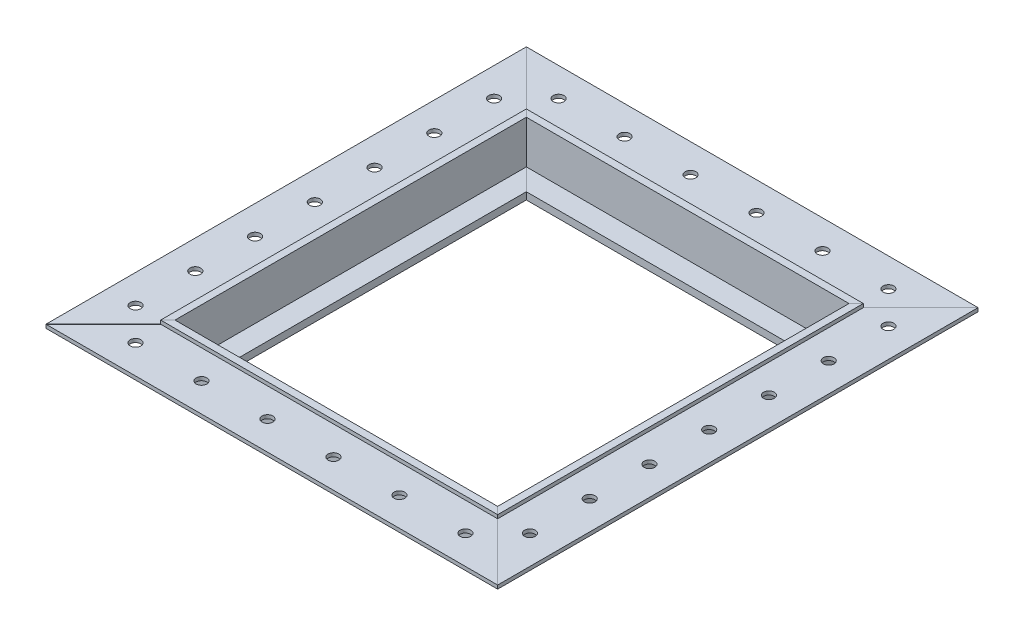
ISO-10303-21;
HEADER;
FILE_DESCRIPTION(('STEP AP214'),'2;1');
FILE_NAME('part.step','',(''),(''),'','','');
FILE_SCHEMA(('AUTOMOTIVE_DESIGN { 1 0 10303 214 1 1 1 1 }'));
ENDSEC;
DATA;
#1=APPLICATION_CONTEXT('core data for automotive mechanical design processes');
#2=APPLICATION_PROTOCOL_DEFINITION('international standard','automotive_design',2000,#1);
#3=PRODUCT_CONTEXT('',#1,'mechanical');
#4=PRODUCT('Part','Part','',(#3));
#5=PRODUCT_RELATED_PRODUCT_CATEGORY('part','',(#4));
#6=PRODUCT_DEFINITION_FORMATION('','',#4);
#7=PRODUCT_DEFINITION_CONTEXT('part definition',#1,'design');
#8=PRODUCT_DEFINITION('design','',#6,#7);
#9=PRODUCT_DEFINITION_SHAPE('','',#8);
#10=(LENGTH_UNIT() NAMED_UNIT(*) SI_UNIT(.MILLI.,.METRE.));
#11=(NAMED_UNIT(*) PLANE_ANGLE_UNIT() SI_UNIT($,.RADIAN.));
#12=(NAMED_UNIT(*) SI_UNIT($,.STERADIAN.) SOLID_ANGLE_UNIT());
#13=UNCERTAINTY_MEASURE_WITH_UNIT(LENGTH_MEASURE(1.E-05),#10,'distance_accuracy_value','');
#14=(GEOMETRIC_REPRESENTATION_CONTEXT(3) GLOBAL_UNCERTAINTY_ASSIGNED_CONTEXT((#13)) GLOBAL_UNIT_ASSIGNED_CONTEXT((#10,
#11,#12)) REPRESENTATION_CONTEXT('',''));
#15=CARTESIAN_POINT('',(0.,0.,0.));
#16=DIRECTION('',(0.,0.,1.));
#17=DIRECTION('',(1.,0.,0.));
#18=AXIS2_PLACEMENT_3D('',#15,#16,#17);
#19=CARTESIAN_POINT('',(0.,22.2250000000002,77.7875));
#20=DIRECTION('',(0.,-1.,0.));
#21=DIRECTION('',(1.,0.,0.));
#22=AXIS2_PLACEMENT_3D('',#19,#20,#21);
#23=PLANE('',#22);
#24=DIRECTION('',(0.,0.,-1.));
#25=VECTOR('',#24,1.);
#26=CARTESIAN_POINT('',(133.35,22.225,77.7875));
#27=LINE('',#26,#25);
#28=CARTESIAN_POINT('',(133.35,22.225,77.7515789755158));
#29=VERTEX_POINT('',#28);
#30=CARTESIAN_POINT('',(133.35,22.225,-77.7515789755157));
#31=VERTEX_POINT('',#30);
#32=EDGE_CURVE('E149',#29,#31,#27,.T.);
#33=ORIENTED_EDGE('',*,*,#32,.F.);
#34=DIRECTION('',(-0.707106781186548,0.,-0.707106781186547));
#35=VECTOR('',#34,1.);
#36=CARTESIAN_POINT('',(161.942960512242,22.225,106.344539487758));
#37=LINE('',#36,#35);
#38=CARTESIAN_POINT('',(136.525,22.225,80.9265789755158));
#39=VERTEX_POINT('',#38);
#40=EDGE_CURVE('E12',#39,#29,#37,.T.);
#41=ORIENTED_EDGE('',*,*,#40,.F.);
#42=DIRECTION('',(0.,0.,-1.));
#43=VECTOR('',#42,1.);
#44=CARTESIAN_POINT('',(136.525,22.225,77.7875));
#45=LINE('',#44,#43);
#46=CARTESIAN_POINT('',(136.525,22.225,-80.9265789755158));
#47=VERTEX_POINT('',#46);
#48=EDGE_CURVE('E101',#39,#47,#45,.T.);
#49=ORIENTED_EDGE('',*,*,#48,.T.);
#50=DIRECTION('',(0.707106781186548,0.,-0.707106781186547));
#51=VECTOR('',#50,1.);
#52=CARTESIAN_POINT('',(161.942960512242,22.225,-106.344539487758));
#53=LINE('',#52,#51);
#54=EDGE_CURVE('E57',#31,#47,#53,.T.);
#55=ORIENTED_EDGE('',*,*,#54,.F.);
#56=EDGE_LOOP('',(#33,#41,#49,#55));
#57=FACE_BOUND('',#56,.T.);
#58=ADVANCED_FACE('F48',(#57),#23,.F.);
#59=CARTESIAN_POINT('',(123.825,0.,77.7875));
#60=DIRECTION('',(1.,0.,0.));
#61=DIRECTION('',(0.,0.,-1.));
#62=AXIS2_PLACEMENT_3D('',#59,#60,#61);
#63=PLANE('',#62);
#64=DIRECTION('',(0.,0.,-1.));
#65=VECTOR('',#64,1.);
#66=CARTESIAN_POINT('',(123.825,0.,77.7875));
#67=LINE('',#66,#65);
#68=CARTESIAN_POINT('',(123.825,-1.76287549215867E-13,68.2265789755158));
#69=VERTEX_POINT('',#68);
#70=CARTESIAN_POINT('',(123.825,-1.76287549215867E-13,-68.2265789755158));
#71=VERTEX_POINT('',#70);
#72=EDGE_CURVE('E108',#69,#71,#67,.T.);
#73=ORIENTED_EDGE('',*,*,#72,.F.);
#74=DIRECTION('',(0.,1.,0.));
#75=VECTOR('',#74,1.);
#76=CARTESIAN_POINT('',(123.825,0.,68.2265789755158));
#77=LINE('',#76,#75);
#78=CARTESIAN_POINT('',(123.825,3.17500000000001,68.2265789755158));
#79=VERTEX_POINT('',#78);
#80=EDGE_CURVE('E91',#69,#79,#77,.T.);
#81=ORIENTED_EDGE('',*,*,#80,.T.);
#82=DIRECTION('',(0.,0.,-1.));
#83=VECTOR('',#82,1.);
#84=CARTESIAN_POINT('',(123.825,3.17500000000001,77.7875));
#85=LINE('',#84,#83);
#86=CARTESIAN_POINT('',(123.825,3.17500000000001,-68.2265789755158));
#87=VERTEX_POINT('',#86);
#88=EDGE_CURVE('E100',#79,#87,#85,.T.);
#89=ORIENTED_EDGE('',*,*,#88,.T.);
#90=DIRECTION('',(0.,-1.,0.));
#91=VECTOR('',#90,1.);
#92=CARTESIAN_POINT('',(123.825,1.59555307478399E-13,-68.2265789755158));
#93=LINE('',#92,#91);
#94=EDGE_CURVE('E116',#87,#71,#93,.T.);
#95=ORIENTED_EDGE('',*,*,#94,.T.);
#96=EDGE_LOOP('',(#73,#81,#89,#95));
#97=FACE_BOUND('',#96,.T.);
#98=ADVANCED_FACE('F114',(#97),#63,.F.);
#99=CARTESIAN_POINT('',(136.525,0.,77.7875));
#100=DIRECTION('',(-1.,0.,0.));
#101=DIRECTION('',(0.,0.,1.));
#102=AXIS2_PLACEMENT_3D('',#99,#100,#101);
#103=PLANE('',#102);
#104=DIRECTION('',(0.,0.,-1.));
#105=VECTOR('',#104,1.);
#106=CARTESIAN_POINT('',(136.525,19.05,77.7875));
#107=LINE('',#106,#105);
#108=CARTESIAN_POINT('',(136.525,19.05,80.9265789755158));
#109=VERTEX_POINT('',#108);
#110=CARTESIAN_POINT('',(136.525,19.05,-80.9265789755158));
#111=VERTEX_POINT('',#110);
#112=EDGE_CURVE('E127',#109,#111,#107,.T.);
#113=ORIENTED_EDGE('',*,*,#112,.F.);
#114=DIRECTION('',(0.,-1.,0.));
#115=VECTOR('',#114,1.);
#116=CARTESIAN_POINT('',(136.525,0.,80.9265789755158));
#117=LINE('',#116,#115);
#118=CARTESIAN_POINT('',(136.525,-1.90376777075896E-13,80.9265789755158));
#119=VERTEX_POINT('',#118);
#120=EDGE_CURVE('E64',#109,#119,#117,.T.);
#121=ORIENTED_EDGE('',*,*,#120,.T.);
#122=DIRECTION('',(0.,0.,-1.));
#123=VECTOR('',#122,1.);
#124=CARTESIAN_POINT('',(136.525,0.,77.7875));
#125=LINE('',#124,#123);
#126=CARTESIAN_POINT('',(136.525,-1.90376777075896E-13,-80.9265789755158));
#127=VERTEX_POINT('',#126);
#128=EDGE_CURVE('E111',#119,#127,#125,.T.);
#129=ORIENTED_EDGE('',*,*,#128,.T.);
#130=DIRECTION('',(0.,1.,0.));
#131=VECTOR('',#130,1.);
#132=CARTESIAN_POINT('',(136.525,1.73433095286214E-13,-80.9265789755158));
#133=LINE('',#132,#131);
#134=EDGE_CURVE('E126',#127,#111,#133,.T.);
#135=ORIENTED_EDGE('',*,*,#134,.T.);
#136=EDGE_LOOP('',(#113,#121,#129,#135));
#137=FACE_BOUND('',#136,.T.);
#138=ADVANCED_FACE('F229',(#137),#103,.F.);
#139=CARTESIAN_POINT('',(0.,3.17499999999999,77.7875));
#140=DIRECTION('',(0.,-1.,0.));
#141=DIRECTION('',(1.,0.,0.));
#142=AXIS2_PLACEMENT_3D('',#139,#140,#141);
#143=PLANE('',#142);
#144=ORIENTED_EDGE('',*,*,#88,.F.);
#145=DIRECTION('',(0.707106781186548,0.,0.707106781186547));
#146=VECTOR('',#145,1.);
#147=CARTESIAN_POINT('',(66.692960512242,3.175,11.0945394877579));
#148=LINE('',#147,#146);
#149=CARTESIAN_POINT('',(133.35,3.17500000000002,77.7515789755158));
#150=VERTEX_POINT('',#149);
#151=EDGE_CURVE('E95',#79,#150,#148,.T.);
#152=ORIENTED_EDGE('',*,*,#151,.T.);
#153=DIRECTION('',(0.,0.,-1.));
#154=VECTOR('',#153,1.);
#155=CARTESIAN_POINT('',(133.35,3.17500000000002,77.7875));
#156=LINE('',#155,#154);
#157=CARTESIAN_POINT('',(133.35,3.17500000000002,-77.7515789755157));
#158=VERTEX_POINT('',#157);
#159=EDGE_CURVE('E153',#150,#158,#156,.T.);
#160=ORIENTED_EDGE('',*,*,#159,.T.);
#161=DIRECTION('',(-0.707106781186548,0.,0.707106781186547));
#162=VECTOR('',#161,1.);
#163=CARTESIAN_POINT('',(-11.094539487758,3.17499999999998,66.692960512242));
#164=LINE('',#163,#162);
#165=EDGE_CURVE('E112',#158,#87,#164,.T.);
#166=ORIENTED_EDGE('',*,*,#165,.T.);
#167=EDGE_LOOP('',(#144,#152,#160,#166));
#168=FACE_BOUND('',#167,.T.);
#169=ADVANCED_FACE('F182',(#168),#143,.F.);
#170=CARTESIAN_POINT('',(0.,0.,77.7875));
#171=DIRECTION('',(0.,1.,0.));
#172=DIRECTION('',(-1.,0.,0.));
#173=AXIS2_PLACEMENT_3D('',#170,#171,#172);
#174=PLANE('',#173);
#175=ORIENTED_EDGE('',*,*,#128,.F.);
#176=DIRECTION('',(-0.707106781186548,0.,-0.707106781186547));
#177=VECTOR('',#176,1.);
#178=CARTESIAN_POINT('',(161.942960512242,-2.18575157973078E-13,106.344539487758));
#179=LINE('',#178,#177);
#180=EDGE_CURVE('E51',#119,#69,#179,.T.);
#181=ORIENTED_EDGE('',*,*,#180,.T.);
#182=ORIENTED_EDGE('',*,*,#72,.T.);
#183=DIRECTION('',(0.707106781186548,0.,-0.707106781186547));
#184=VECTOR('',#183,1.);
#185=CARTESIAN_POINT('',(161.942960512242,-2.18575157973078E-13,-106.344539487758));
#186=LINE('',#185,#184);
#187=EDGE_CURVE('E117',#71,#127,#186,.T.);
#188=ORIENTED_EDGE('',*,*,#187,.T.);
#189=EDGE_LOOP('',(#175,#181,#182,#188));
#190=FACE_BOUND('',#189,.T.);
#191=ADVANCED_FACE('F106',(#190),#174,.F.);
#192=CARTESIAN_POINT('',(0.,19.05,77.7875));
#193=DIRECTION('',(0.,1.,0.));
#194=DIRECTION('',(0.,0.,1.));
#195=AXIS2_PLACEMENT_3D('',#192,#193,#194);
#196=PLANE('',#195);
#197=CARTESIAN_POINT('',(149.225,19.05,-79.375));
#198=DIRECTION('',(0.,1.,0.));
#199=DIRECTION('',(0.,0.,1.));
#200=AXIS2_PLACEMENT_3D('',#197,#198,#199);
#201=CIRCLE('',#200,2.38125);
#202=CARTESIAN_POINT('',(149.225,19.05,-76.99375));
#203=VERTEX_POINT('',#202);
#204=EDGE_CURVE('E148',#203,#203,#201,.T.);
#205=ORIENTED_EDGE('',*,*,#204,.T.);
#206=EDGE_LOOP('',(#205));
#207=FACE_BOUND('',#206,.T.);
#208=CARTESIAN_POINT('',(149.225,19.05,-52.916666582));
#209=DIRECTION('',(0.,1.,0.));
#210=DIRECTION('',(0.,0.,1.));
#211=AXIS2_PLACEMENT_3D('',#208,#209,#210);
#212=CIRCLE('',#211,2.38125);
#213=CARTESIAN_POINT('',(149.225,19.05,-50.535416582));
#214=VERTEX_POINT('',#213);
#215=EDGE_CURVE('E235',#214,#214,#212,.T.);
#216=ORIENTED_EDGE('',*,*,#215,.T.);
#217=EDGE_LOOP('',(#216));
#218=FACE_BOUND('',#217,.T.);
#219=CARTESIAN_POINT('',(149.225,19.05,-26.458333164));
#220=DIRECTION('',(0.,1.,0.));
#221=DIRECTION('',(0.,0.,1.));
#222=AXIS2_PLACEMENT_3D('',#219,#220,#221);
#223=CIRCLE('',#222,2.38125000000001);
#224=CARTESIAN_POINT('',(149.225,19.05,-24.077083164));
#225=VERTEX_POINT('',#224);
#226=EDGE_CURVE('E238',#225,#225,#223,.T.);
#227=ORIENTED_EDGE('',*,*,#226,.T.);
#228=EDGE_LOOP('',(#227));
#229=FACE_BOUND('',#228,.T.);
#230=CARTESIAN_POINT('',(149.225,19.05,2.54000001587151E-07));
#231=DIRECTION('',(0.,1.,0.));
#232=DIRECTION('',(0.,0.,1.));
#233=AXIS2_PLACEMENT_3D('',#230,#231,#232);
#234=CIRCLE('',#233,2.38124999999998);
#235=CARTESIAN_POINT('',(149.225,19.05,2.38125025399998));
#236=VERTEX_POINT('',#235);
#237=EDGE_CURVE('E241',#236,#236,#234,.T.);
#238=ORIENTED_EDGE('',*,*,#237,.T.);
#239=EDGE_LOOP('',(#238));
#240=FACE_BOUND('',#239,.T.);
#241=CARTESIAN_POINT('',(149.225,19.05,26.458333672));
#242=DIRECTION('',(0.,1.,0.));
#243=DIRECTION('',(0.,0.,1.));
#244=AXIS2_PLACEMENT_3D('',#241,#242,#243);
#245=CIRCLE('',#244,2.38124999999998);
#246=CARTESIAN_POINT('',(149.225,19.05,28.839583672));
#247=VERTEX_POINT('',#246);
#248=EDGE_CURVE('E244',#247,#247,#245,.T.);
#249=ORIENTED_EDGE('',*,*,#248,.T.);
#250=EDGE_LOOP('',(#249));
#251=FACE_BOUND('',#250,.T.);
#252=CARTESIAN_POINT('',(149.225,19.05,52.91666709));
#253=DIRECTION('',(0.,1.,0.));
#254=DIRECTION('',(0.,0.,1.));
#255=AXIS2_PLACEMENT_3D('',#252,#253,#254);
#256=CIRCLE('',#255,2.38124999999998);
#257=CARTESIAN_POINT('',(149.225,19.05,55.29791709));
#258=VERTEX_POINT('',#257);
#259=EDGE_CURVE('E247',#258,#258,#256,.T.);
#260=ORIENTED_EDGE('',*,*,#259,.T.);
#261=EDGE_LOOP('',(#260));
#262=FACE_BOUND('',#261,.T.);
#263=CARTESIAN_POINT('',(149.225,19.05,79.375000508));
#264=DIRECTION('',(0.,1.,0.));
#265=DIRECTION('',(0.,0.,1.));
#266=AXIS2_PLACEMENT_3D('',#263,#264,#265);
#267=CIRCLE('',#266,2.38125000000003);
#268=CARTESIAN_POINT('',(149.225,19.05,81.756250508));
#269=VERTEX_POINT('',#268);
#270=EDGE_CURVE('E250',#269,#269,#267,.T.);
#271=ORIENTED_EDGE('',*,*,#270,.T.);
#272=EDGE_LOOP('',(#271));
#273=FACE_BOUND('',#272,.T.);
#274=DIRECTION('',(0.,0.,-1.));
#275=VECTOR('',#274,1.);
#276=CARTESIAN_POINT('',(161.925,19.05,77.7875));
#277=LINE('',#276,#275);
#278=CARTESIAN_POINT('',(161.925,19.05,106.326578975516));
#279=VERTEX_POINT('',#278);
#280=CARTESIAN_POINT('',(161.925,19.05,-106.326578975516));
#281=VERTEX_POINT('',#280);
#282=EDGE_CURVE('E131',#279,#281,#277,.T.);
#283=ORIENTED_EDGE('',*,*,#282,.F.);
#284=DIRECTION('',(-0.707106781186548,0.,-0.707106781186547));
#285=VECTOR('',#284,1.);
#286=CARTESIAN_POINT('',(66.6929605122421,19.05,11.0945394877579));
#287=LINE('',#286,#285);
#288=EDGE_CURVE('E119',#279,#109,#287,.T.);
#289=ORIENTED_EDGE('',*,*,#288,.T.);
#290=ORIENTED_EDGE('',*,*,#112,.T.);
#291=DIRECTION('',(0.707106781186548,0.,-0.707106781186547));
#292=VECTOR('',#291,1.);
#293=CARTESIAN_POINT('',(-11.0945394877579,19.05,66.692960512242));
#294=LINE('',#293,#292);
#295=EDGE_CURVE('E130',#111,#281,#294,.T.);
#296=ORIENTED_EDGE('',*,*,#295,.T.);
#297=EDGE_LOOP('',(#283,#289,#290,#296));
#298=FACE_BOUND('',#297,.T.);
#299=ADVANCED_FACE('F225',(#207,#218,#229,#240,#251,#262,#273,#298),#196,.F.);
#300=CARTESIAN_POINT('',(161.925,0.,77.7875));
#301=DIRECTION('',(-1.,0.,0.));
#302=DIRECTION('',(0.,0.,1.));
#303=AXIS2_PLACEMENT_3D('',#300,#301,#302);
#304=PLANE('',#303);
#305=DIRECTION('',(0.,0.,-1.));
#306=VECTOR('',#305,1.);
#307=CARTESIAN_POINT('',(161.925,20.6375,77.7875));
#308=LINE('',#307,#306);
#309=CARTESIAN_POINT('',(161.925,20.6375,106.326578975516));
#310=VERTEX_POINT('',#309);
#311=CARTESIAN_POINT('',(161.925,20.6375,-106.326578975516));
#312=VERTEX_POINT('',#311);
#313=EDGE_CURVE('E136',#310,#312,#308,.T.);
#314=ORIENTED_EDGE('',*,*,#313,.F.);
#315=DIRECTION('',(0.,-1.,0.));
#316=VECTOR('',#315,1.);
#317=CARTESIAN_POINT('',(161.925,0.,106.326578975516));
#318=LINE('',#317,#316);
#319=EDGE_CURVE('E135',#310,#279,#318,.T.);
#320=ORIENTED_EDGE('',*,*,#319,.T.);
#321=ORIENTED_EDGE('',*,*,#282,.T.);
#322=DIRECTION('',(0.,1.,0.));
#323=VECTOR('',#322,1.);
#324=CARTESIAN_POINT('',(161.925,2.01188670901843E-13,-106.326578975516));
#325=LINE('',#324,#323);
#326=EDGE_CURVE('E134',#281,#312,#325,.T.);
#327=ORIENTED_EDGE('',*,*,#326,.T.);
#328=EDGE_LOOP('',(#314,#320,#321,#327));
#329=FACE_BOUND('',#328,.T.);
#330=ADVANCED_FACE('F218',(#329),#304,.F.);
#331=CARTESIAN_POINT('',(0.,20.6375,77.7875));
#332=DIRECTION('',(0.,-1.,0.));
#333=DIRECTION('',(1.,0.,0.));
#334=AXIS2_PLACEMENT_3D('',#331,#332,#333);
#335=PLANE('',#334);
#336=CARTESIAN_POINT('',(149.225,20.6375,-79.375));
#337=DIRECTION('',(0.,1.,0.));
#338=DIRECTION('',(1.,0.,0.));
#339=AXIS2_PLACEMENT_3D('',#336,#337,#338);
#340=CIRCLE('',#339,2.38125);
#341=CARTESIAN_POINT('',(151.60625,20.6375,-79.375));
#342=VERTEX_POINT('',#341);
#343=EDGE_CURVE('E253',#342,#342,#340,.T.);
#344=ORIENTED_EDGE('',*,*,#343,.F.);
#345=EDGE_LOOP('',(#344));
#346=FACE_BOUND('',#345,.T.);
#347=CARTESIAN_POINT('',(149.225,20.6375,-52.916666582));
#348=DIRECTION('',(0.,1.,0.));
#349=DIRECTION('',(1.,0.,0.));
#350=AXIS2_PLACEMENT_3D('',#347,#348,#349);
#351=CIRCLE('',#350,2.38125);
#352=CARTESIAN_POINT('',(151.60625,20.6375,-52.916666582));
#353=VERTEX_POINT('',#352);
#354=EDGE_CURVE('E269',#353,#353,#351,.T.);
#355=ORIENTED_EDGE('',*,*,#354,.F.);
#356=EDGE_LOOP('',(#355));
#357=FACE_BOUND('',#356,.T.);
#358=CARTESIAN_POINT('',(149.225,20.6375,-26.458333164));
#359=DIRECTION('',(0.,1.,0.));
#360=DIRECTION('',(1.,0.,0.));
#361=AXIS2_PLACEMENT_3D('',#358,#359,#360);
#362=CIRCLE('',#361,2.38125000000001);
#363=CARTESIAN_POINT('',(151.60625,20.6375,-26.458333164));
#364=VERTEX_POINT('',#363);
#365=EDGE_CURVE('E266',#364,#364,#362,.T.);
#366=ORIENTED_EDGE('',*,*,#365,.F.);
#367=EDGE_LOOP('',(#366));
#368=FACE_BOUND('',#367,.T.);
#369=CARTESIAN_POINT('',(149.225,20.6375,2.54000001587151E-07));
#370=DIRECTION('',(0.,1.,0.));
#371=DIRECTION('',(1.,0.,0.));
#372=AXIS2_PLACEMENT_3D('',#369,#370,#371);
#373=CIRCLE('',#372,2.38124999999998);
#374=CARTESIAN_POINT('',(151.60625,20.6375,2.54000001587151E-07));
#375=VERTEX_POINT('',#374);
#376=EDGE_CURVE('E263',#375,#375,#373,.T.);
#377=ORIENTED_EDGE('',*,*,#376,.F.);
#378=EDGE_LOOP('',(#377));
#379=FACE_BOUND('',#378,.T.);
#380=CARTESIAN_POINT('',(149.225,20.6375,26.458333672));
#381=DIRECTION('',(0.,1.,0.));
#382=DIRECTION('',(1.,0.,0.));
#383=AXIS2_PLACEMENT_3D('',#380,#381,#382);
#384=CIRCLE('',#383,2.38124999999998);
#385=CARTESIAN_POINT('',(151.60625,20.6375,26.458333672));
#386=VERTEX_POINT('',#385);
#387=EDGE_CURVE('E260',#386,#386,#384,.T.);
#388=ORIENTED_EDGE('',*,*,#387,.F.);
#389=EDGE_LOOP('',(#388));
#390=FACE_BOUND('',#389,.T.);
#391=CARTESIAN_POINT('',(149.225,20.6375,52.91666709));
#392=DIRECTION('',(0.,1.,0.));
#393=DIRECTION('',(1.,0.,0.));
#394=AXIS2_PLACEMENT_3D('',#391,#392,#393);
#395=CIRCLE('',#394,2.38124999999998);
#396=CARTESIAN_POINT('',(151.60625,20.6375,52.91666709));
#397=VERTEX_POINT('',#396);
#398=EDGE_CURVE('E257',#397,#397,#395,.T.);
#399=ORIENTED_EDGE('',*,*,#398,.F.);
#400=EDGE_LOOP('',(#399));
#401=FACE_BOUND('',#400,.T.);
#402=CARTESIAN_POINT('',(149.225,20.6375,79.375000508));
#403=DIRECTION('',(0.,1.,0.));
#404=DIRECTION('',(1.,0.,0.));
#405=AXIS2_PLACEMENT_3D('',#402,#403,#404);
#406=CIRCLE('',#405,2.38125000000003);
#407=CARTESIAN_POINT('',(151.60625,20.6375,79.375000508));
#408=VERTEX_POINT('',#407);
#409=EDGE_CURVE('E254',#408,#408,#406,.T.);
#410=ORIENTED_EDGE('',*,*,#409,.F.);
#411=EDGE_LOOP('',(#410));
#412=FACE_BOUND('',#411,.T.);
#413=DIRECTION('',(0.,0.,-1.));
#414=VECTOR('',#413,1.);
#415=CARTESIAN_POINT('',(136.525,20.6375,77.7875));
#416=LINE('',#415,#414);
#417=CARTESIAN_POINT('',(136.525,20.6375,80.9265789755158));
#418=VERTEX_POINT('',#417);
#419=CARTESIAN_POINT('',(136.525,20.6375,-80.9265789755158));
#420=VERTEX_POINT('',#419);
#421=EDGE_CURVE('E141',#418,#420,#416,.T.);
#422=ORIENTED_EDGE('',*,*,#421,.F.);
#423=DIRECTION('',(0.707106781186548,0.,0.707106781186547));
#424=VECTOR('',#423,1.);
#425=CARTESIAN_POINT('',(66.6929605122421,20.6375,11.0945394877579));
#426=LINE('',#425,#424);
#427=EDGE_CURVE('E140',#418,#310,#426,.T.);
#428=ORIENTED_EDGE('',*,*,#427,.T.);
#429=ORIENTED_EDGE('',*,*,#313,.T.);
#430=DIRECTION('',(-0.707106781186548,0.,0.707106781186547));
#431=VECTOR('',#430,1.);
#432=CARTESIAN_POINT('',(-11.0945394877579,20.6375,66.692960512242));
#433=LINE('',#432,#431);
#434=EDGE_CURVE('E139',#312,#420,#433,.T.);
#435=ORIENTED_EDGE('',*,*,#434,.T.);
#436=EDGE_LOOP('',(#422,#428,#429,#435));
#437=FACE_BOUND('',#436,.T.);
#438=ADVANCED_FACE('F213',(#346,#357,#368,#379,#390,#401,#412,#437),#335,.F.);
#439=CARTESIAN_POINT('',(136.525,0.,77.7875));
#440=DIRECTION('',(-1.,0.,0.));
#441=DIRECTION('',(0.,0.,1.));
#442=AXIS2_PLACEMENT_3D('',#439,#440,#441);
#443=PLANE('',#442);
#444=ORIENTED_EDGE('',*,*,#48,.F.);
#445=DIRECTION('',(0.,-1.,0.));
#446=VECTOR('',#445,1.);
#447=CARTESIAN_POINT('',(136.525,0.,80.9265789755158));
#448=LINE('',#447,#446);
#449=EDGE_CURVE('E145',#39,#418,#448,.T.);
#450=ORIENTED_EDGE('',*,*,#449,.T.);
#451=ORIENTED_EDGE('',*,*,#421,.T.);
#452=DIRECTION('',(0.,1.,0.));
#453=VECTOR('',#452,1.);
#454=CARTESIAN_POINT('',(136.525,1.73433095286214E-13,-80.9265789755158));
#455=LINE('',#454,#453);
#456=EDGE_CURVE('E144',#420,#47,#455,.T.);
#457=ORIENTED_EDGE('',*,*,#456,.T.);
#458=EDGE_LOOP('',(#444,#450,#451,#457));
#459=FACE_BOUND('',#458,.T.);
#460=ADVANCED_FACE('F206',(#459),#443,.F.);
#461=CARTESIAN_POINT('',(133.35,-1.94289029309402E-13,77.7875));
#462=DIRECTION('',(1.,0.,0.));
#463=DIRECTION('',(0.,1.,0.));
#464=AXIS2_PLACEMENT_3D('',#461,#462,#463);
#465=PLANE('',#464);
#466=ORIENTED_EDGE('',*,*,#159,.F.);
#467=DIRECTION('',(0.,1.,0.));
#468=VECTOR('',#467,1.);
#469=CARTESIAN_POINT('',(133.35,-1.9427594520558E-13,77.7515789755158));
#470=LINE('',#469,#468);
#471=EDGE_CURVE('E152',#150,#29,#470,.T.);
#472=ORIENTED_EDGE('',*,*,#471,.T.);
#473=ORIENTED_EDGE('',*,*,#32,.T.);
#474=DIRECTION('',(0.,-1.,0.));
#475=VECTOR('',#474,1.);
#476=CARTESIAN_POINT('',(133.35,-2.50943578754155E-13,-77.7515789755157));
#477=LINE('',#476,#475);
#478=EDGE_CURVE('E123',#31,#158,#477,.T.);
#479=ORIENTED_EDGE('',*,*,#478,.T.);
#480=EDGE_LOOP('',(#466,#472,#473,#479));
#481=FACE_BOUND('',#480,.T.);
#482=ADVANCED_FACE('F188',(#481),#465,.F.);
#483=CARTESIAN_POINT('',(161.942960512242,-2.18575157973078E-13,-106.344539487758));
#484=DIRECTION('',(0.707106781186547,0.,0.707106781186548));
#485=DIRECTION('',(0.707106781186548,0.,-0.707106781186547));
#486=AXIS2_PLACEMENT_3D('',#483,#484,#485);
#487=PLANE('',#486);
#488=ORIENTED_EDGE('',*,*,#187,.F.);
#489=ORIENTED_EDGE('',*,*,#94,.F.);
#490=ORIENTED_EDGE('',*,*,#165,.F.);
#491=ORIENTED_EDGE('',*,*,#478,.F.);
#492=ORIENTED_EDGE('',*,*,#54,.T.);
#493=ORIENTED_EDGE('',*,*,#456,.F.);
#494=ORIENTED_EDGE('',*,*,#434,.F.);
#495=ORIENTED_EDGE('',*,*,#326,.F.);
#496=ORIENTED_EDGE('',*,*,#295,.F.);
#497=ORIENTED_EDGE('',*,*,#134,.F.);
#498=EDGE_LOOP('',(#488,#489,#490,#491,#492,#493,#494,#495,#496,#497));
#499=FACE_BOUND('',#498,.T.);
#500=ADVANCED_FACE('F195',(#499),#487,.F.);
#501=CARTESIAN_POINT('',(161.942960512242,-2.18575157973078E-13,106.344539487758));
#502=DIRECTION('',(0.707106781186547,0.,-0.707106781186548));
#503=DIRECTION('',(-0.707106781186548,0.,-0.707106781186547));
#504=AXIS2_PLACEMENT_3D('',#501,#502,#503);
#505=PLANE('',#504);
#506=ORIENTED_EDGE('',*,*,#288,.F.);
#507=ORIENTED_EDGE('',*,*,#319,.F.);
#508=ORIENTED_EDGE('',*,*,#427,.F.);
#509=ORIENTED_EDGE('',*,*,#449,.F.);
#510=ORIENTED_EDGE('',*,*,#40,.T.);
#511=ORIENTED_EDGE('',*,*,#471,.F.);
#512=ORIENTED_EDGE('',*,*,#151,.F.);
#513=ORIENTED_EDGE('',*,*,#80,.F.);
#514=ORIENTED_EDGE('',*,*,#180,.F.);
#515=ORIENTED_EDGE('',*,*,#120,.F.);
#516=EDGE_LOOP('',(#506,#507,#508,#509,#510,#511,#512,#513,#514,#515));
#517=FACE_BOUND('',#516,.T.);
#518=ADVANCED_FACE('F93',(#517),#505,.F.);
#519=CARTESIAN_POINT('',(149.225,18.0975,79.375000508));
#520=DIRECTION('',(0.,1.,0.));
#521=DIRECTION('',(-1.,0.,0.));
#522=AXIS2_PLACEMENT_3D('',#519,#520,#521);
#523=CYLINDRICAL_SURFACE('',#522,2.38125000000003);
#524=ORIENTED_EDGE('',*,*,#409,.T.);
#525=EDGE_LOOP('',(#524));
#526=FACE_BOUND('',#525,.T.);
#527=ORIENTED_EDGE('',*,*,#270,.F.);
#528=EDGE_LOOP('',(#527));
#529=FACE_BOUND('',#528,.T.);
#530=ADVANCED_FACE('F293',(#526,#529),#523,.F.);
#531=CARTESIAN_POINT('',(149.225,18.0975,52.91666709));
#532=DIRECTION('',(0.,1.,0.));
#533=DIRECTION('',(-1.,0.,0.));
#534=AXIS2_PLACEMENT_3D('',#531,#532,#533);
#535=CYLINDRICAL_SURFACE('',#534,2.38124999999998);
#536=ORIENTED_EDGE('',*,*,#398,.T.);
#537=EDGE_LOOP('',(#536));
#538=FACE_BOUND('',#537,.T.);
#539=ORIENTED_EDGE('',*,*,#259,.F.);
#540=EDGE_LOOP('',(#539));
#541=FACE_BOUND('',#540,.T.);
#542=ADVANCED_FACE('F296',(#538,#541),#535,.F.);
#543=CARTESIAN_POINT('',(149.225,18.0975,26.458333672));
#544=DIRECTION('',(0.,1.,0.));
#545=DIRECTION('',(-1.,0.,0.));
#546=AXIS2_PLACEMENT_3D('',#543,#544,#545);
#547=CYLINDRICAL_SURFACE('',#546,2.38124999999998);
#548=ORIENTED_EDGE('',*,*,#387,.T.);
#549=EDGE_LOOP('',(#548));
#550=FACE_BOUND('',#549,.T.);
#551=ORIENTED_EDGE('',*,*,#248,.F.);
#552=EDGE_LOOP('',(#551));
#553=FACE_BOUND('',#552,.T.);
#554=ADVANCED_FACE('F343',(#550,#553),#547,.F.);
#555=CARTESIAN_POINT('',(149.225,18.0975,2.54000001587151E-07));
#556=DIRECTION('',(0.,1.,0.));
#557=DIRECTION('',(-1.,0.,0.));
#558=AXIS2_PLACEMENT_3D('',#555,#556,#557);
#559=CYLINDRICAL_SURFACE('',#558,2.38124999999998);
#560=ORIENTED_EDGE('',*,*,#376,.T.);
#561=EDGE_LOOP('',(#560));
#562=FACE_BOUND('',#561,.T.);
#563=ORIENTED_EDGE('',*,*,#237,.F.);
#564=EDGE_LOOP('',(#563));
#565=FACE_BOUND('',#564,.T.);
#566=ADVANCED_FACE('F350',(#562,#565),#559,.F.);
#567=CARTESIAN_POINT('',(149.225,18.0975,-26.458333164));
#568=DIRECTION('',(0.,1.,0.));
#569=DIRECTION('',(-1.,0.,0.));
#570=AXIS2_PLACEMENT_3D('',#567,#568,#569);
#571=CYLINDRICAL_SURFACE('',#570,2.38125000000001);
#572=ORIENTED_EDGE('',*,*,#365,.T.);
#573=EDGE_LOOP('',(#572));
#574=FACE_BOUND('',#573,.T.);
#575=ORIENTED_EDGE('',*,*,#226,.F.);
#576=EDGE_LOOP('',(#575));
#577=FACE_BOUND('',#576,.T.);
#578=ADVANCED_FACE('F358',(#574,#577),#571,.F.);
#579=CARTESIAN_POINT('',(149.225,18.0975,-52.916666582));
#580=DIRECTION('',(0.,1.,0.));
#581=DIRECTION('',(-1.,0.,0.));
#582=AXIS2_PLACEMENT_3D('',#579,#580,#581);
#583=CYLINDRICAL_SURFACE('',#582,2.38125);
#584=ORIENTED_EDGE('',*,*,#354,.T.);
#585=EDGE_LOOP('',(#584));
#586=FACE_BOUND('',#585,.T.);
#587=ORIENTED_EDGE('',*,*,#215,.F.);
#588=EDGE_LOOP('',(#587));
#589=FACE_BOUND('',#588,.T.);
#590=ADVANCED_FACE('F366',(#586,#589),#583,.F.);
#591=CARTESIAN_POINT('',(149.225,18.0975,-79.375));
#592=DIRECTION('',(0.,1.,0.));
#593=DIRECTION('',(-1.,0.,0.));
#594=AXIS2_PLACEMENT_3D('',#591,#592,#593);
#595=CYLINDRICAL_SURFACE('',#594,2.38125);
#596=ORIENTED_EDGE('',*,*,#343,.T.);
#597=EDGE_LOOP('',(#596));
#598=FACE_BOUND('',#597,.T.);
#599=ORIENTED_EDGE('',*,*,#204,.F.);
#600=EDGE_LOOP('',(#599));
#601=FACE_BOUND('',#600,.T.);
#602=ADVANCED_FACE('F275',(#598,#601),#595,.F.);
#603=CLOSED_SHELL('',(#58,#98,#138,#169,#191,#299,#330,#438,#460,#482,#500,#518,#530,#542,#554,
#566,#578,#590,#602));
#604=MANIFOLD_SOLID_BREP('B2',#603);
#605=CARTESIAN_POINT('',(-38.0820394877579,0.,106.380460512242));
#606=DIRECTION('',(0.707106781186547,0.,0.707106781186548));
#607=DIRECTION('',(0.707106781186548,0.,-0.707106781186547));
#608=AXIS2_PLACEMENT_3D('',#605,#606,#607);
#609=PLANE('',#608);
#610=DIRECTION('',(0.707106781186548,0.,-0.707106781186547));
#611=VECTOR('',#610,1.);
#612=CARTESIAN_POINT('',(-38.0820394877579,0.,106.380460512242));
#613=LINE('',#612,#611);
#614=CARTESIAN_POINT('',(-12.6640789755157,0.,80.9625));
#615=VERTEX_POINT('',#614);
#616=CARTESIAN_POINT('',(0.0359210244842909,0.,68.2625));
#617=VERTEX_POINT('',#616);
#618=EDGE_CURVE('E689',#615,#617,#613,.T.);
#619=ORIENTED_EDGE('',*,*,#618,.F.);
#620=DIRECTION('',(0.,-1.,0.));
#621=VECTOR('',#620,1.);
#622=CARTESIAN_POINT('',(-12.6640789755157,0.,80.9625));
#623=LINE('',#622,#621);
#624=CARTESIAN_POINT('',(-12.6640789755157,19.05,80.9625));
#625=VERTEX_POINT('',#624);
#626=EDGE_CURVE('E656',#625,#615,#623,.T.);
#627=ORIENTED_EDGE('',*,*,#626,.F.);
#628=DIRECTION('',(0.707106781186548,0.,-0.707106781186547));
#629=VECTOR('',#628,1.);
#630=CARTESIAN_POINT('',(-4.74453948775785,19.05,73.0429605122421));
#631=LINE('',#630,#629);
#632=CARTESIAN_POINT('',(-38.0640789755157,19.05,106.3625));
#633=VERTEX_POINT('',#632);
#634=EDGE_CURVE('E683',#633,#625,#631,.T.);
#635=ORIENTED_EDGE('',*,*,#634,.F.);
#636=DIRECTION('',(0.,-1.,0.));
#637=VECTOR('',#636,1.);
#638=CARTESIAN_POINT('',(-38.0640789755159,9.29458512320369E-13,106.3625));
#639=LINE('',#638,#637);
#640=CARTESIAN_POINT('',(-38.0640789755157,20.6375,106.3625));
#641=VERTEX_POINT('',#640);
#642=EDGE_CURVE('E679',#641,#633,#639,.T.);
#643=ORIENTED_EDGE('',*,*,#642,.F.);
#644=DIRECTION('',(-0.707106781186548,0.,0.707106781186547));
#645=VECTOR('',#644,1.);
#646=CARTESIAN_POINT('',(-4.74453948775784,20.6375,73.0429605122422));
#647=LINE('',#646,#645);
#648=CARTESIAN_POINT('',(-12.6640789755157,20.6375,80.9625));
#649=VERTEX_POINT('',#648);
#650=EDGE_CURVE('E599',#649,#641,#647,.T.);
#651=ORIENTED_EDGE('',*,*,#650,.F.);
#652=DIRECTION('',(0.,-1.,0.));
#653=VECTOR('',#652,1.);
#654=CARTESIAN_POINT('',(-12.6640789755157,0.,80.9625));
#655=LINE('',#654,#653);
#656=CARTESIAN_POINT('',(-12.6640789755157,22.2250000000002,80.9625));
#657=VERTEX_POINT('',#656);
#658=EDGE_CURVE('E595',#657,#649,#655,.T.);
#659=ORIENTED_EDGE('',*,*,#658,.F.);
#660=DIRECTION('',(0.707106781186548,0.,-0.707106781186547));
#661=VECTOR('',#660,1.);
#662=CARTESIAN_POINT('',(-38.0820394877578,22.2250000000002,106.380460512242));
#663=LINE('',#662,#661);
#664=CARTESIAN_POINT('',(-9.48907897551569,22.2250000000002,77.7875));
#665=VERTEX_POINT('',#664);
#666=EDGE_CURVE('E560',#657,#665,#663,.T.);
#667=ORIENTED_EDGE('',*,*,#666,.T.);
#668=DIRECTION('',(0.,1.,0.));
#669=VECTOR('',#668,1.);
#670=CARTESIAN_POINT('',(-9.48907897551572,0.,77.7875));
#671=LINE('',#670,#669);
#672=CARTESIAN_POINT('',(-9.48907897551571,3.17500000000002,77.7875));
#673=VERTEX_POINT('',#672);
#674=EDGE_CURVE('E655',#673,#665,#671,.T.);
#675=ORIENTED_EDGE('',*,*,#674,.F.);
#676=DIRECTION('',(-0.707106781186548,0.,0.707106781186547));
#677=VECTOR('',#676,1.);
#678=CARTESIAN_POINT('',(-4.74453948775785,3.17499999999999,73.0429605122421));
#679=LINE('',#678,#677);
#680=CARTESIAN_POINT('',(0.0359210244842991,3.175,68.2625));
#681=VERTEX_POINT('',#680);
#682=EDGE_CURVE('E672',#681,#673,#679,.T.);
#683=ORIENTED_EDGE('',*,*,#682,.F.);
#684=DIRECTION('',(0.,1.,0.));
#685=VECTOR('',#684,1.);
#686=CARTESIAN_POINT('',(0.0359210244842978,0.,68.2625));
#687=LINE('',#686,#685);
#688=EDGE_CURVE('E576',#617,#681,#687,.T.);
#689=ORIENTED_EDGE('',*,*,#688,.F.);
#690=EDGE_LOOP('',(#619,#627,#635,#643,#651,#659,#667,#675,#683,#689));
#691=FACE_BOUND('',#690,.T.);
#692=ADVANCED_FACE('F551',(#691),#609,.F.);
#693=CARTESIAN_POINT('',(-38.1,9.29811783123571E-13,106.3625));
#694=DIRECTION('',(0.,0.,-1.));
#695=DIRECTION('',(0.,1.,0.));
#696=AXIS2_PLACEMENT_3D('',#693,#694,#695);
#697=PLANE('',#696);
#698=DIRECTION('',(1.,0.,0.));
#699=VECTOR('',#698,1.);
#700=CARTESIAN_POINT('',(-38.1,19.05,106.3625));
#701=LINE('',#700,#699);
#702=CARTESIAN_POINT('',(161.889078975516,19.05,106.3625));
#703=VERTEX_POINT('',#702);
#704=EDGE_CURVE('E676',#633,#703,#701,.T.);
#705=ORIENTED_EDGE('',*,*,#704,.T.);
#706=DIRECTION('',(0.,1.,0.));
#707=VECTOR('',#706,1.);
#708=CARTESIAN_POINT('',(161.889078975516,2.45956312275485E-12,106.3625));
#709=LINE('',#708,#707);
#710=CARTESIAN_POINT('',(161.889078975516,20.6375,106.3625));
#711=VERTEX_POINT('',#710);
#712=EDGE_CURVE('E46',#703,#711,#709,.T.);
#713=ORIENTED_EDGE('',*,*,#712,.T.);
#714=DIRECTION('',(1.,0.,0.));
#715=VECTOR('',#714,1.);
#716=CARTESIAN_POINT('',(-38.1,20.6375,106.3625));
#717=LINE('',#716,#715);
#718=EDGE_CURVE('E673',#641,#711,#717,.T.);
#719=ORIENTED_EDGE('',*,*,#718,.F.);
#720=ORIENTED_EDGE('',*,*,#642,.T.);
#721=EDGE_LOOP('',(#705,#713,#719,#720));
#722=FACE_BOUND('',#721,.T.);
#723=ADVANCED_FACE('F734',(#722),#697,.F.);
#724=CARTESIAN_POINT('',(0.,20.6375,77.7875));
#725=DIRECTION('',(0.,-1.,0.));
#726=DIRECTION('',(1.,0.,0.));
#727=AXIS2_PLACEMENT_3D('',#724,#725,#726);
#728=PLANE('',#727);
#729=CARTESIAN_POINT('',(-11.1125,20.6375,93.6624999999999));
#730=DIRECTION('',(0.,1.,0.));
#731=DIRECTION('',(1.,0.,0.));
#732=AXIS2_PLACEMENT_3D('',#729,#730,#731);
#733=CIRCLE('',#732,2.3749);
#734=CARTESIAN_POINT('',(-8.73760000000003,20.6375,93.6624999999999));
#735=VERTEX_POINT('',#734);
#736=EDGE_CURVE('E704',#735,#735,#733,.T.);
#737=ORIENTED_EDGE('',*,*,#736,.F.);
#738=EDGE_LOOP('',(#737));
#739=FACE_BOUND('',#738,.T.);
#740=CARTESIAN_POINT('',(18.0975,20.6375,93.6624999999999));
#741=DIRECTION('',(0.,1.,0.));
#742=DIRECTION('',(1.,0.,0.));
#743=AXIS2_PLACEMENT_3D('',#740,#741,#742);
#744=CIRCLE('',#743,2.3749);
#745=CARTESIAN_POINT('',(20.4724,20.6375,93.6624999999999));
#746=VERTEX_POINT('',#745);
#747=EDGE_CURVE('E835',#746,#746,#744,.T.);
#748=ORIENTED_EDGE('',*,*,#747,.F.);
#749=EDGE_LOOP('',(#748));
#750=FACE_BOUND('',#749,.T.);
#751=CARTESIAN_POINT('',(47.3074999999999,20.6375,93.6624999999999));
#752=DIRECTION('',(0.,1.,0.));
#753=DIRECTION('',(1.,0.,0.));
#754=AXIS2_PLACEMENT_3D('',#751,#752,#753);
#755=CIRCLE('',#754,2.3749);
#756=CARTESIAN_POINT('',(49.6823999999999,20.6375,93.6624999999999));
#757=VERTEX_POINT('',#756);
#758=EDGE_CURVE('E794',#757,#757,#755,.T.);
#759=ORIENTED_EDGE('',*,*,#758,.F.);
#760=EDGE_LOOP('',(#759));
#761=FACE_BOUND('',#760,.T.);
#762=CARTESIAN_POINT('',(76.5174999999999,20.6375,93.6625));
#763=DIRECTION('',(0.,1.,0.));
#764=DIRECTION('',(1.,0.,0.));
#765=AXIS2_PLACEMENT_3D('',#762,#763,#764);
#766=CIRCLE('',#765,2.3749);
#767=CARTESIAN_POINT('',(78.8923999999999,20.6375,93.6625));
#768=VERTEX_POINT('',#767);
#769=EDGE_CURVE('E831',#768,#768,#766,.T.);
#770=ORIENTED_EDGE('',*,*,#769,.F.);
#771=EDGE_LOOP('',(#770));
#772=FACE_BOUND('',#771,.T.);
#773=CARTESIAN_POINT('',(105.7275,20.6375,93.6625));
#774=DIRECTION('',(0.,1.,0.));
#775=DIRECTION('',(1.,0.,0.));
#776=AXIS2_PLACEMENT_3D('',#773,#774,#775);
#777=CIRCLE('',#776,2.3749);
#778=CARTESIAN_POINT('',(108.1024,20.6375,93.6625));
#779=VERTEX_POINT('',#778);
#780=EDGE_CURVE('E828',#779,#779,#777,.T.);
#781=ORIENTED_EDGE('',*,*,#780,.F.);
#782=EDGE_LOOP('',(#781));
#783=FACE_BOUND('',#782,.T.);
#784=CARTESIAN_POINT('',(134.9375,20.6375,93.6625));
#785=DIRECTION('',(0.,1.,0.));
#786=DIRECTION('',(1.,0.,0.));
#787=AXIS2_PLACEMENT_3D('',#784,#785,#786);
#788=CIRCLE('',#787,2.37490000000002);
#789=CARTESIAN_POINT('',(137.3124,20.6375,93.6625));
#790=VERTEX_POINT('',#789);
#791=EDGE_CURVE('E825',#790,#790,#788,.T.);
#792=ORIENTED_EDGE('',*,*,#791,.F.);
#793=EDGE_LOOP('',(#792));
#794=FACE_BOUND('',#793,.T.);
#795=ORIENTED_EDGE('',*,*,#718,.T.);
#796=DIRECTION('',(-0.707106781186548,0.,-0.707106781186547));
#797=VECTOR('',#796,1.);
#798=CARTESIAN_POINT('',(66.6570394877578,20.6375,11.1304605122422));
#799=LINE('',#798,#797);
#800=CARTESIAN_POINT('',(136.489078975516,20.6375,80.9625));
#801=VERTEX_POINT('',#800);
#802=EDGE_CURVE('E568',#711,#801,#799,.T.);
#803=ORIENTED_EDGE('',*,*,#802,.T.);
#804=DIRECTION('',(1.,0.,0.));
#805=VECTOR('',#804,1.);
#806=CARTESIAN_POINT('',(-38.1,20.6375,80.9625));
#807=LINE('',#806,#805);
#808=EDGE_CURVE('E669',#649,#801,#807,.T.);
#809=ORIENTED_EDGE('',*,*,#808,.F.);
#810=ORIENTED_EDGE('',*,*,#650,.T.);
#811=EDGE_LOOP('',(#795,#803,#809,#810));
#812=FACE_BOUND('',#811,.T.);
#813=ADVANCED_FACE('F739',(#739,#750,#761,#772,#783,#794,#812),#728,.F.);
#814=CARTESIAN_POINT('',(-38.1,0.,80.9625));
#815=DIRECTION('',(0.,0.,-1.));
#816=DIRECTION('',(-1.,0.,0.));
#817=AXIS2_PLACEMENT_3D('',#814,#815,#816);
#818=PLANE('',#817);
#819=DIRECTION('',(1.,0.,0.));
#820=VECTOR('',#819,1.);
#821=CARTESIAN_POINT('',(-38.1,0.,80.9625));
#822=LINE('',#821,#820);
#823=CARTESIAN_POINT('',(136.489078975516,-1.89842640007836E-13,80.9625));
#824=VERTEX_POINT('',#823);
#825=EDGE_CURVE('E659',#615,#824,#822,.T.);
#826=ORIENTED_EDGE('',*,*,#825,.T.);
#827=DIRECTION('',(0.,1.,0.));
#828=VECTOR('',#827,1.);
#829=CARTESIAN_POINT('',(136.489078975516,-1.90780330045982E-13,80.9625));
#830=LINE('',#829,#828);
#831=CARTESIAN_POINT('',(136.489078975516,19.05,80.9625));
#832=VERTEX_POINT('',#831);
#833=EDGE_CURVE('E642',#824,#832,#830,.T.);
#834=ORIENTED_EDGE('',*,*,#833,.T.);
#835=DIRECTION('',(1.,0.,0.));
#836=VECTOR('',#835,1.);
#837=CARTESIAN_POINT('',(-38.1,19.05,80.9625));
#838=LINE('',#837,#836);
#839=EDGE_CURVE('E680',#625,#832,#838,.T.);
#840=ORIENTED_EDGE('',*,*,#839,.F.);
#841=ORIENTED_EDGE('',*,*,#626,.T.);
#842=EDGE_LOOP('',(#826,#834,#840,#841));
#843=FACE_BOUND('',#842,.T.);
#844=ADVANCED_FACE('F756',(#843),#818,.F.);
#845=CARTESIAN_POINT('',(0.,19.05,77.7875));
#846=DIRECTION('',(0.,1.,0.));
#847=DIRECTION('',(0.,0.,1.));
#848=AXIS2_PLACEMENT_3D('',#845,#846,#847);
#849=PLANE('',#848);
#850=CARTESIAN_POINT('',(-11.1125,19.05,93.6624999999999));
#851=DIRECTION('',(0.,1.,0.));
#852=DIRECTION('',(0.,0.,1.));
#853=AXIS2_PLACEMENT_3D('',#850,#851,#852);
#854=CIRCLE('',#853,2.3749);
#855=CARTESIAN_POINT('',(-11.1125,19.05,96.0373999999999));
#856=VERTEX_POINT('',#855);
#857=EDGE_CURVE('E555',#856,#856,#854,.T.);
#858=ORIENTED_EDGE('',*,*,#857,.T.);
#859=EDGE_LOOP('',(#858));
#860=FACE_BOUND('',#859,.T.);
#861=CARTESIAN_POINT('',(18.0975,19.05,93.6624999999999));
#862=DIRECTION('',(0.,1.,0.));
#863=DIRECTION('',(0.,0.,1.));
#864=AXIS2_PLACEMENT_3D('',#861,#862,#863);
#865=CIRCLE('',#864,2.3749);
#866=CARTESIAN_POINT('',(18.0975,19.05,96.0373999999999));
#867=VERTEX_POINT('',#866);
#868=EDGE_CURVE('E712',#867,#867,#865,.T.);
#869=ORIENTED_EDGE('',*,*,#868,.T.);
#870=EDGE_LOOP('',(#869));
#871=FACE_BOUND('',#870,.T.);
#872=CARTESIAN_POINT('',(47.3074999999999,19.05,93.6624999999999));
#873=DIRECTION('',(0.,1.,0.));
#874=DIRECTION('',(0.,0.,1.));
#875=AXIS2_PLACEMENT_3D('',#872,#873,#874);
#876=CIRCLE('',#875,2.3749);
#877=CARTESIAN_POINT('',(47.3074999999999,19.05,96.0373999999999));
#878=VERTEX_POINT('',#877);
#879=EDGE_CURVE('E710',#878,#878,#876,.T.);
#880=ORIENTED_EDGE('',*,*,#879,.T.);
#881=EDGE_LOOP('',(#880));
#882=FACE_BOUND('',#881,.T.);
#883=CARTESIAN_POINT('',(76.5174999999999,19.05,93.6625));
#884=DIRECTION('',(0.,1.,0.));
#885=DIRECTION('',(0.,0.,1.));
#886=AXIS2_PLACEMENT_3D('',#883,#884,#885);
#887=CIRCLE('',#886,2.3749);
#888=CARTESIAN_POINT('',(76.5174999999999,19.05,96.0374));
#889=VERTEX_POINT('',#888);
#890=EDGE_CURVE('E707',#889,#889,#887,.T.);
#891=ORIENTED_EDGE('',*,*,#890,.T.);
#892=EDGE_LOOP('',(#891));
#893=FACE_BOUND('',#892,.T.);
#894=CARTESIAN_POINT('',(105.7275,19.05,93.6625));
#895=DIRECTION('',(0.,1.,0.));
#896=DIRECTION('',(0.,0.,1.));
#897=AXIS2_PLACEMENT_3D('',#894,#895,#896);
#898=CIRCLE('',#897,2.3749);
#899=CARTESIAN_POINT('',(105.7275,19.05,96.0374));
#900=VERTEX_POINT('',#899);
#901=EDGE_CURVE('E703',#900,#900,#898,.T.);
#902=ORIENTED_EDGE('',*,*,#901,.T.);
#903=EDGE_LOOP('',(#902));
#904=FACE_BOUND('',#903,.T.);
#905=CARTESIAN_POINT('',(134.9375,19.05,93.6625));
#906=DIRECTION('',(0.,1.,0.));
#907=DIRECTION('',(0.,0.,1.));
#908=AXIS2_PLACEMENT_3D('',#905,#906,#907);
#909=CIRCLE('',#908,2.37490000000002);
#910=CARTESIAN_POINT('',(134.9375,19.05,96.0374));
#911=VERTEX_POINT('',#910);
#912=EDGE_CURVE('E700',#911,#911,#909,.T.);
#913=ORIENTED_EDGE('',*,*,#912,.T.);
#914=EDGE_LOOP('',(#913));
#915=FACE_BOUND('',#914,.T.);
#916=ORIENTED_EDGE('',*,*,#839,.T.);
#917=DIRECTION('',(0.707106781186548,0.,0.707106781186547));
#918=VECTOR('',#917,1.);
#919=CARTESIAN_POINT('',(66.6570394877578,19.05,11.1304605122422));
#920=LINE('',#919,#918);
#921=EDGE_CURVE('E807',#832,#703,#920,.T.);
#922=ORIENTED_EDGE('',*,*,#921,.T.);
#923=ORIENTED_EDGE('',*,*,#704,.F.);
#924=ORIENTED_EDGE('',*,*,#634,.T.);
#925=EDGE_LOOP('',(#916,#922,#923,#924));
#926=FACE_BOUND('',#925,.T.);
#927=ADVANCED_FACE('F719',(#860,#871,#882,#893,#904,#915,#926),#849,.F.);
#928=CARTESIAN_POINT('',(-38.1,0.,68.2625));
#929=DIRECTION('',(0.,0.,1.));
#930=DIRECTION('',(1.,0.,0.));
#931=AXIS2_PLACEMENT_3D('',#928,#929,#930);
#932=PLANE('',#931);
#933=DIRECTION('',(1.,0.,0.));
#934=VECTOR('',#933,1.);
#935=CARTESIAN_POINT('',(-38.1,3.17500000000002,68.2625));
#936=LINE('',#935,#934);
#937=CARTESIAN_POINT('',(123.789078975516,3.17500000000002,68.2625));
#938=VERTEX_POINT('',#937);
#939=EDGE_CURVE('E665',#681,#938,#936,.T.);
#940=ORIENTED_EDGE('',*,*,#939,.T.);
#941=DIRECTION('',(0.,-1.,0.));
#942=VECTOR('',#941,1.);
#943=CARTESIAN_POINT('',(123.789078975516,-1.76902542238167E-13,68.2625));
#944=LINE('',#943,#942);
#945=CARTESIAN_POINT('',(123.789078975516,-1.75860052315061E-13,68.2625));
#946=VERTEX_POINT('',#945);
#947=EDGE_CURVE('E668',#938,#946,#944,.T.);
#948=ORIENTED_EDGE('',*,*,#947,.T.);
#949=DIRECTION('',(1.,0.,0.));
#950=VECTOR('',#949,1.);
#951=CARTESIAN_POINT('',(-38.1,0.,68.2625));
#952=LINE('',#951,#950);
#953=EDGE_CURVE('E686',#617,#946,#952,.T.);
#954=ORIENTED_EDGE('',*,*,#953,.F.);
#955=ORIENTED_EDGE('',*,*,#688,.T.);
#956=EDGE_LOOP('',(#940,#948,#954,#955));
#957=FACE_BOUND('',#956,.T.);
#958=ADVANCED_FACE('F744',(#957),#932,.F.);
#959=CARTESIAN_POINT('',(0.,0.,77.7875));
#960=DIRECTION('',(0.,1.,0.));
#961=DIRECTION('',(-1.,0.,0.));
#962=AXIS2_PLACEMENT_3D('',#959,#960,#961);
#963=PLANE('',#962);
#964=ORIENTED_EDGE('',*,*,#953,.T.);
#965=DIRECTION('',(0.707106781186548,0.,0.707106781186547));
#966=VECTOR('',#965,1.);
#967=CARTESIAN_POINT('',(161.907039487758,-2.18575157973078E-13,106.380460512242));
#968=LINE('',#967,#966);
#969=EDGE_CURVE('E650',#946,#824,#968,.T.);
#970=ORIENTED_EDGE('',*,*,#969,.T.);
#971=ORIENTED_EDGE('',*,*,#825,.F.);
#972=ORIENTED_EDGE('',*,*,#618,.T.);
#973=EDGE_LOOP('',(#964,#970,#971,#972));
#974=FACE_BOUND('',#973,.T.);
#975=ADVANCED_FACE('F751',(#974),#963,.F.);
#976=CARTESIAN_POINT('',(-38.1,0.,77.7875));
#977=DIRECTION('',(0.,0.,1.));
#978=DIRECTION('',(1.,0.,0.));
#979=AXIS2_PLACEMENT_3D('',#976,#977,#978);
#980=PLANE('',#979);
#981=DIRECTION('',(1.,0.,0.));
#982=VECTOR('',#981,1.);
#983=CARTESIAN_POINT('',(-38.1,22.225,77.7875));
#984=LINE('',#983,#982);
#985=CARTESIAN_POINT('',(133.314078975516,22.225,77.7875));
#986=VERTEX_POINT('',#985);
#987=EDGE_CURVE('E647',#665,#986,#984,.T.);
#988=ORIENTED_EDGE('',*,*,#987,.T.);
#989=DIRECTION('',(0.,-1.,0.));
#990=VECTOR('',#989,1.);
#991=CARTESIAN_POINT('',(133.314078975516,-1.87310883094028E-13,77.7875));
#992=LINE('',#991,#990);
#993=CARTESIAN_POINT('',(133.314078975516,3.17500000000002,77.7875));
#994=VERTEX_POINT('',#993);
#995=EDGE_CURVE('E632',#986,#994,#992,.T.);
#996=ORIENTED_EDGE('',*,*,#995,.T.);
#997=DIRECTION('',(-1.,0.,0.));
#998=VECTOR('',#997,1.);
#999=CARTESIAN_POINT('',(0.,3.17499999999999,77.7875));
#1000=LINE('',#999,#998);
#1001=EDGE_CURVE('E661',#994,#673,#1000,.T.);
#1002=ORIENTED_EDGE('',*,*,#1001,.T.);
#1003=ORIENTED_EDGE('',*,*,#674,.T.);
#1004=EDGE_LOOP('',(#988,#996,#1002,#1003));
#1005=FACE_BOUND('',#1004,.T.);
#1006=ADVANCED_FACE('F653',(#1005),#980,.F.);
#1007=CARTESIAN_POINT('',(0.,3.17499999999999,77.7875));
#1008=DIRECTION('',(0.,-1.,0.));
#1009=DIRECTION('',(1.,0.,0.));
#1010=AXIS2_PLACEMENT_3D('',#1007,#1008,#1009);
#1011=PLANE('',#1010);
#1012=ORIENTED_EDGE('',*,*,#1001,.F.);
#1013=DIRECTION('',(-0.707106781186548,0.,-0.707106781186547));
#1014=VECTOR('',#1013,1.);
#1015=CARTESIAN_POINT('',(66.6570394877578,3.175,11.1304605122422));
#1016=LINE('',#1015,#1014);
#1017=EDGE_CURVE('E638',#994,#938,#1016,.T.);
#1018=ORIENTED_EDGE('',*,*,#1017,.T.);
#1019=ORIENTED_EDGE('',*,*,#939,.F.);
#1020=ORIENTED_EDGE('',*,*,#682,.T.);
#1021=EDGE_LOOP('',(#1012,#1018,#1019,#1020));
#1022=FACE_BOUND('',#1021,.T.);
#1023=ADVANCED_FACE('F746',(#1022),#1011,.F.);
#1024=CARTESIAN_POINT('',(-38.1,0.,80.9625));
#1025=DIRECTION('',(0.,0.,-1.));
#1026=DIRECTION('',(-1.,0.,0.));
#1027=AXIS2_PLACEMENT_3D('',#1024,#1025,#1026);
#1028=PLANE('',#1027);
#1029=ORIENTED_EDGE('',*,*,#808,.T.);
#1030=DIRECTION('',(0.,1.,0.));
#1031=VECTOR('',#1030,1.);
#1032=CARTESIAN_POINT('',(136.489078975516,-1.90780330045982E-13,80.9625));
#1033=LINE('',#1032,#1031);
#1034=CARTESIAN_POINT('',(136.489078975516,22.225,80.9625));
#1035=VERTEX_POINT('',#1034);
#1036=EDGE_CURVE('E811',#801,#1035,#1033,.T.);
#1037=ORIENTED_EDGE('',*,*,#1036,.T.);
#1038=DIRECTION('',(1.,0.,0.));
#1039=VECTOR('',#1038,1.);
#1040=CARTESIAN_POINT('',(-38.1,22.225,80.9625));
#1041=LINE('',#1040,#1039);
#1042=EDGE_CURVE('E649',#657,#1035,#1041,.T.);
#1043=ORIENTED_EDGE('',*,*,#1042,.F.);
#1044=ORIENTED_EDGE('',*,*,#658,.T.);
#1045=EDGE_LOOP('',(#1029,#1037,#1043,#1044));
#1046=FACE_BOUND('',#1045,.T.);
#1047=ADVANCED_FACE('F749',(#1046),#1028,.F.);
#1048=CARTESIAN_POINT('',(0.,22.2250000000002,77.7875));
#1049=DIRECTION('',(0.,-1.,0.));
#1050=DIRECTION('',(1.,0.,0.));
#1051=AXIS2_PLACEMENT_3D('',#1048,#1049,#1050);
#1052=PLANE('',#1051);
#1053=ORIENTED_EDGE('',*,*,#1042,.T.);
#1054=DIRECTION('',(0.707106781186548,0.,0.707106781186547));
#1055=VECTOR('',#1054,1.);
#1056=CARTESIAN_POINT('',(161.907039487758,22.225,106.380460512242));
#1057=LINE('',#1056,#1055);
#1058=EDGE_CURVE('E635',#986,#1035,#1057,.T.);
#1059=ORIENTED_EDGE('',*,*,#1058,.F.);
#1060=ORIENTED_EDGE('',*,*,#987,.F.);
#1061=ORIENTED_EDGE('',*,*,#666,.F.);
#1062=EDGE_LOOP('',(#1053,#1059,#1060,#1061));
#1063=FACE_BOUND('',#1062,.T.);
#1064=ADVANCED_FACE('F553',(#1063),#1052,.F.);
#1065=CARTESIAN_POINT('',(161.907039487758,-2.18575157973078E-13,106.380460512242));
#1066=DIRECTION('',(-0.707106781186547,0.,0.707106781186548));
#1067=DIRECTION('',(0.707106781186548,0.,0.707106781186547));
#1068=AXIS2_PLACEMENT_3D('',#1065,#1066,#1067);
#1069=PLANE('',#1068);
#1070=ORIENTED_EDGE('',*,*,#1017,.F.);
#1071=ORIENTED_EDGE('',*,*,#995,.F.);
#1072=ORIENTED_EDGE('',*,*,#1058,.T.);
#1073=ORIENTED_EDGE('',*,*,#1036,.F.);
#1074=ORIENTED_EDGE('',*,*,#802,.F.);
#1075=ORIENTED_EDGE('',*,*,#712,.F.);
#1076=ORIENTED_EDGE('',*,*,#921,.F.);
#1077=ORIENTED_EDGE('',*,*,#833,.F.);
#1078=ORIENTED_EDGE('',*,*,#969,.F.);
#1079=ORIENTED_EDGE('',*,*,#947,.F.);
#1080=EDGE_LOOP('',(#1070,#1071,#1072,#1073,#1074,#1075,#1076,#1077,#1078,#1079));
#1081=FACE_BOUND('',#1080,.T.);
#1082=ADVANCED_FACE('F634',(#1081),#1069,.F.);
#1083=CARTESIAN_POINT('',(134.9375,18.0975,93.6625));
#1084=DIRECTION('',(0.,1.,0.));
#1085=DIRECTION('',(-1.,0.,0.));
#1086=AXIS2_PLACEMENT_3D('',#1083,#1084,#1085);
#1087=CYLINDRICAL_SURFACE('',#1086,2.37490000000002);
#1088=ORIENTED_EDGE('',*,*,#791,.T.);
#1089=EDGE_LOOP('',(#1088));
#1090=FACE_BOUND('',#1089,.T.);
#1091=ORIENTED_EDGE('',*,*,#912,.F.);
#1092=EDGE_LOOP('',(#1091));
#1093=FACE_BOUND('',#1092,.T.);
#1094=ADVANCED_FACE('F775',(#1090,#1093),#1087,.F.);
#1095=CARTESIAN_POINT('',(105.7275,18.0975,93.6625));
#1096=DIRECTION('',(0.,1.,0.));
#1097=DIRECTION('',(-1.,0.,0.));
#1098=AXIS2_PLACEMENT_3D('',#1095,#1096,#1097);
#1099=CYLINDRICAL_SURFACE('',#1098,2.3749);
#1100=ORIENTED_EDGE('',*,*,#780,.T.);
#1101=EDGE_LOOP('',(#1100));
#1102=FACE_BOUND('',#1101,.T.);
#1103=ORIENTED_EDGE('',*,*,#901,.F.);
#1104=EDGE_LOOP('',(#1103));
#1105=FACE_BOUND('',#1104,.T.);
#1106=ADVANCED_FACE('F778',(#1102,#1105),#1099,.F.);
#1107=CARTESIAN_POINT('',(76.5174999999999,18.0975,93.6625));
#1108=DIRECTION('',(0.,1.,0.));
#1109=DIRECTION('',(-1.,0.,0.));
#1110=AXIS2_PLACEMENT_3D('',#1107,#1108,#1109);
#1111=CYLINDRICAL_SURFACE('',#1110,2.3749);
#1112=ORIENTED_EDGE('',*,*,#769,.T.);
#1113=EDGE_LOOP('',(#1112));
#1114=FACE_BOUND('',#1113,.T.);
#1115=ORIENTED_EDGE('',*,*,#890,.F.);
#1116=EDGE_LOOP('',(#1115));
#1117=FACE_BOUND('',#1116,.T.);
#1118=ADVANCED_FACE('F782',(#1114,#1117),#1111,.F.);
#1119=CARTESIAN_POINT('',(47.3074999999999,18.0975,93.6624999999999));
#1120=DIRECTION('',(0.,1.,0.));
#1121=DIRECTION('',(-1.,0.,0.));
#1122=AXIS2_PLACEMENT_3D('',#1119,#1120,#1121);
#1123=CYLINDRICAL_SURFACE('',#1122,2.3749);
#1124=ORIENTED_EDGE('',*,*,#758,.T.);
#1125=EDGE_LOOP('',(#1124));
#1126=FACE_BOUND('',#1125,.T.);
#1127=ORIENTED_EDGE('',*,*,#879,.F.);
#1128=EDGE_LOOP('',(#1127));
#1129=FACE_BOUND('',#1128,.T.);
#1130=ADVANCED_FACE('F729',(#1126,#1129),#1123,.F.);
#1131=CARTESIAN_POINT('',(18.0975,18.0975,93.6624999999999));
#1132=DIRECTION('',(0.,1.,0.));
#1133=DIRECTION('',(-1.,0.,0.));
#1134=AXIS2_PLACEMENT_3D('',#1131,#1132,#1133);
#1135=CYLINDRICAL_SURFACE('',#1134,2.3749);
#1136=ORIENTED_EDGE('',*,*,#747,.T.);
#1137=EDGE_LOOP('',(#1136));
#1138=FACE_BOUND('',#1137,.T.);
#1139=ORIENTED_EDGE('',*,*,#868,.F.);
#1140=EDGE_LOOP('',(#1139));
#1141=FACE_BOUND('',#1140,.T.);
#1142=ADVANCED_FACE('F723',(#1138,#1141),#1135,.F.);
#1143=CARTESIAN_POINT('',(-11.1125,18.0975,93.6624999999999));
#1144=DIRECTION('',(0.,1.,0.));
#1145=DIRECTION('',(-1.,0.,0.));
#1146=AXIS2_PLACEMENT_3D('',#1143,#1144,#1145);
#1147=CYLINDRICAL_SURFACE('',#1146,2.3749);
#1148=ORIENTED_EDGE('',*,*,#736,.T.);
#1149=EDGE_LOOP('',(#1148));
#1150=FACE_BOUND('',#1149,.T.);
#1151=ORIENTED_EDGE('',*,*,#857,.F.);
#1152=EDGE_LOOP('',(#1151));
#1153=FACE_BOUND('',#1152,.T.);
#1154=ADVANCED_FACE('F721',(#1150,#1153),#1147,.F.);
#1155=CLOSED_SHELL('',(#692,#723,#813,#844,#927,#958,#975,#1006,#1023,#1047,#1064,#1082,#1094,
#1106,#1118,#1130,#1142,#1154));
#1156=MANIFOLD_SOLID_BREP('B6',#1155);
#1157=CARTESIAN_POINT('',(-38.1179605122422,0.,-106.344539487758));
#1158=DIRECTION('',(-0.707106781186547,0.,0.707106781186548));
#1159=DIRECTION('',(0.707106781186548,0.,0.707106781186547));
#1160=AXIS2_PLACEMENT_3D('',#1157,#1158,#1159);
#1161=PLANE('',#1160);
#1162=DIRECTION('',(0.,-1.,0.));
#1163=VECTOR('',#1162,1.);
#1164=CARTESIAN_POINT('',(0.,3.17499999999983,-68.2265789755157));
#1165=LINE('',#1164,#1163);
#1166=CARTESIAN_POINT('',(0.,3.17499999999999,-68.2265789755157));
#1167=VERTEX_POINT('',#1166);
#1168=CARTESIAN_POINT('',(0.,0.,-68.2265789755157));
#1169=VERTEX_POINT('',#1168);
#1170=EDGE_CURVE('E1126',#1167,#1169,#1165,.T.);
#1171=ORIENTED_EDGE('',*,*,#1170,.T.);
#1172=DIRECTION('',(0.707106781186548,0.,0.707106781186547));
#1173=VECTOR('',#1172,1.);
#1174=CARTESIAN_POINT('',(-38.1179605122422,0.,-106.344539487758));
#1175=LINE('',#1174,#1173);
#1176=CARTESIAN_POINT('',(-12.7,0.,-80.9265789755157));
#1177=VERTEX_POINT('',#1176);
#1178=EDGE_CURVE('E1116',#1177,#1169,#1175,.T.);
#1179=ORIENTED_EDGE('',*,*,#1178,.F.);
#1180=DIRECTION('',(0.,1.,0.));
#1181=VECTOR('',#1180,1.);
#1182=CARTESIAN_POINT('',(-12.7,-1.74988396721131E-13,-80.9265789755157));
#1183=LINE('',#1182,#1181);
#1184=CARTESIAN_POINT('',(-12.7,19.05,-80.9265789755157));
#1185=VERTEX_POINT('',#1184);
#1186=EDGE_CURVE('E1108',#1177,#1185,#1183,.T.);
#1187=ORIENTED_EDGE('',*,*,#1186,.T.);
#1188=DIRECTION('',(0.707106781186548,0.,0.707106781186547));
#1189=VECTOR('',#1188,1.);
#1190=CARTESIAN_POINT('',(73.0070394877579,19.05,4.78046051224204));
#1191=LINE('',#1190,#1189);
#1192=CARTESIAN_POINT('',(-38.1,19.05,-106.326578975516));
#1193=VERTEX_POINT('',#1192);
#1194=EDGE_CURVE('E1092',#1193,#1185,#1191,.T.);
#1195=ORIENTED_EDGE('',*,*,#1194,.F.);
#1196=DIRECTION('',(0.,1.,0.));
#1197=VECTOR('',#1196,1.);
#1198=CARTESIAN_POINT('',(-38.1,-1.16187220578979E-13,-106.326578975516));
#1199=LINE('',#1198,#1197);
#1200=CARTESIAN_POINT('',(-38.1,20.6375,-106.326578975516));
#1201=VERTEX_POINT('',#1200);
#1202=EDGE_CURVE('E1101',#1193,#1201,#1199,.T.);
#1203=ORIENTED_EDGE('',*,*,#1202,.T.);
#1204=DIRECTION('',(-0.707106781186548,0.,-0.707106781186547));
#1205=VECTOR('',#1204,1.);
#1206=CARTESIAN_POINT('',(73.0070394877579,20.6375,4.78046051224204));
#1207=LINE('',#1206,#1205);
#1208=CARTESIAN_POINT('',(-12.7,20.6375,-80.9265789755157));
#1209=VERTEX_POINT('',#1208);
#1210=EDGE_CURVE('E1087',#1209,#1201,#1207,.T.);
#1211=ORIENTED_EDGE('',*,*,#1210,.F.);
#1212=DIRECTION('',(0.,1.,0.));
#1213=VECTOR('',#1212,1.);
#1214=CARTESIAN_POINT('',(-12.7,20.6374999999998,-80.9265789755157));
#1215=LINE('',#1214,#1213);
#1216=CARTESIAN_POINT('',(-12.7,22.2250000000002,-80.9265789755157));
#1217=VERTEX_POINT('',#1216);
#1218=EDGE_CURVE('E1097',#1209,#1217,#1215,.T.);
#1219=ORIENTED_EDGE('',*,*,#1218,.T.);
#1220=DIRECTION('',(0.707106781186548,0.,0.707106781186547));
#1221=VECTOR('',#1220,1.);
#1222=CARTESIAN_POINT('',(-38.1179605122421,22.2250000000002,-106.344539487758));
#1223=LINE('',#1222,#1221);
#1224=CARTESIAN_POINT('',(-9.525,22.2250000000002,-77.7515789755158));
#1225=VERTEX_POINT('',#1224);
#1226=EDGE_CURVE('E1105',#1217,#1225,#1223,.T.);
#1227=ORIENTED_EDGE('',*,*,#1226,.T.);
#1228=DIRECTION('',(0.,-1.,0.));
#1229=VECTOR('',#1228,1.);
#1230=CARTESIAN_POINT('',(-9.525,22.2249999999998,-77.7515789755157));
#1231=LINE('',#1230,#1229);
#1232=CARTESIAN_POINT('',(-9.525,3.175,-77.7515789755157));
#1233=VERTEX_POINT('',#1232);
#1234=EDGE_CURVE('E1029',#1225,#1233,#1231,.T.);
#1235=ORIENTED_EDGE('',*,*,#1234,.T.);
#1236=DIRECTION('',(-0.707106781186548,0.,-0.707106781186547));
#1237=VECTOR('',#1236,1.);
#1238=CARTESIAN_POINT('',(73.0070394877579,3.175,4.78046051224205));
#1239=LINE('',#1238,#1237);
#1240=EDGE_CURVE('E1120',#1167,#1233,#1239,.T.);
#1241=ORIENTED_EDGE('',*,*,#1240,.F.);
#1242=EDGE_LOOP('',(#1171,#1179,#1187,#1195,#1203,#1211,#1219,#1227,#1235,#1241));
#1243=FACE_BOUND('',#1242,.T.);
#1244=ADVANCED_FACE('F1020',(#1243),#1161,.F.);
#1245=CARTESIAN_POINT('',(-9.525,22.225,77.7875));
#1246=DIRECTION('',(1.,0.,0.));
#1247=DIRECTION('',(0.,1.,0.));
#1248=AXIS2_PLACEMENT_3D('',#1245,#1246,#1247);
#1249=PLANE('',#1248);
#1250=DIRECTION('',(0.,1.,0.));
#1251=VECTOR('',#1250,1.);
#1252=CARTESIAN_POINT('',(-9.525,22.225,77.7515789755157));
#1253=LINE('',#1252,#1251);
#1254=CARTESIAN_POINT('',(-9.525,3.175,77.7515789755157));
#1255=VERTEX_POINT('',#1254);
#1256=CARTESIAN_POINT('',(-9.525,22.2250000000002,77.7515789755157));
#1257=VERTEX_POINT('',#1256);
#1258=EDGE_CURVE('E1198',#1255,#1257,#1253,.T.);
#1259=ORIENTED_EDGE('',*,*,#1258,.F.);
#1260=DIRECTION('',(0.,0.,-1.));
#1261=VECTOR('',#1260,1.);
#1262=CARTESIAN_POINT('',(-9.525,3.175,77.7875));
#1263=LINE('',#1262,#1261);
#1264=EDGE_CURVE('E1118',#1255,#1233,#1263,.T.);
#1265=ORIENTED_EDGE('',*,*,#1264,.T.);
#1266=ORIENTED_EDGE('',*,*,#1234,.F.);
#1267=DIRECTION('',(0.,0.,-1.));
#1268=VECTOR('',#1267,1.);
#1269=CARTESIAN_POINT('',(-9.525,22.225,77.7875));
#1270=LINE('',#1269,#1268);
#1271=EDGE_CURVE('E1123',#1257,#1225,#1270,.T.);
#1272=ORIENTED_EDGE('',*,*,#1271,.F.);
#1273=EDGE_LOOP('',(#1259,#1265,#1266,#1272));
#1274=FACE_BOUND('',#1273,.T.);
#1275=ADVANCED_FACE('F1243',(#1274),#1249,.T.);
#1276=CARTESIAN_POINT('',(0.,3.17499999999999,77.7875));
#1277=DIRECTION('',(0.,-1.,0.));
#1278=DIRECTION('',(1.,0.,0.));
#1279=AXIS2_PLACEMENT_3D('',#1276,#1277,#1278);
#1280=PLANE('',#1279);
#1281=ORIENTED_EDGE('',*,*,#1264,.F.);
#1282=DIRECTION('',(0.707106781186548,0.,-0.707106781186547));
#1283=VECTOR('',#1282,1.);
#1284=CARTESIAN_POINT('',(-4.78046051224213,3.17499999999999,73.0070394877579));
#1285=LINE('',#1284,#1283);
#1286=CARTESIAN_POINT('',(0.,3.17499999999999,68.2265789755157));
#1287=VERTEX_POINT('',#1286);
#1288=EDGE_CURVE('E1199',#1255,#1287,#1285,.T.);
#1289=ORIENTED_EDGE('',*,*,#1288,.T.);
#1290=DIRECTION('',(0.,0.,-1.));
#1291=VECTOR('',#1290,1.);
#1292=CARTESIAN_POINT('',(0.,3.175,77.7875));
#1293=LINE('',#1292,#1291);
#1294=EDGE_CURVE('E1045',#1287,#1167,#1293,.T.);
#1295=ORIENTED_EDGE('',*,*,#1294,.T.);
#1296=ORIENTED_EDGE('',*,*,#1240,.T.);
#1297=EDGE_LOOP('',(#1281,#1289,#1295,#1296));
#1298=FACE_BOUND('',#1297,.T.);
#1299=ADVANCED_FACE('F1244',(#1298),#1280,.F.);
#1300=CARTESIAN_POINT('',(0.,0.,77.7875));
#1301=DIRECTION('',(0.,1.,0.));
#1302=DIRECTION('',(-1.,0.,0.));
#1303=AXIS2_PLACEMENT_3D('',#1300,#1301,#1302);
#1304=PLANE('',#1303);
#1305=DIRECTION('',(0.,0.,-1.));
#1306=VECTOR('',#1305,1.);
#1307=CARTESIAN_POINT('',(0.,0.,77.7875));
#1308=LINE('',#1307,#1306);
#1309=CARTESIAN_POINT('',(0.,0.,68.2265789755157));
#1310=VERTEX_POINT('',#1309);
#1311=EDGE_CURVE('E1121',#1310,#1169,#1308,.T.);
#1312=ORIENTED_EDGE('',*,*,#1311,.F.);
#1313=DIRECTION('',(-0.707106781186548,0.,0.707106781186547));
#1314=VECTOR('',#1313,1.);
#1315=CARTESIAN_POINT('',(-38.1179605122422,0.,106.344539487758));
#1316=LINE('',#1315,#1314);
#1317=CARTESIAN_POINT('',(-12.7,0.,80.9265789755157));
#1318=VERTEX_POINT('',#1317);
#1319=EDGE_CURVE('E1184',#1310,#1318,#1316,.T.);
#1320=ORIENTED_EDGE('',*,*,#1319,.T.);
#1321=DIRECTION('',(0.,0.,-1.));
#1322=VECTOR('',#1321,1.);
#1323=CARTESIAN_POINT('',(-12.7,0.,77.7875));
#1324=LINE('',#1323,#1322);
#1325=EDGE_CURVE('E1129',#1318,#1177,#1324,.T.);
#1326=ORIENTED_EDGE('',*,*,#1325,.T.);
#1327=ORIENTED_EDGE('',*,*,#1178,.T.);
#1328=EDGE_LOOP('',(#1312,#1320,#1326,#1327));
#1329=FACE_BOUND('',#1328,.T.);
#1330=ADVANCED_FACE('F1216',(#1329),#1304,.F.);
#1331=CARTESIAN_POINT('',(0.,3.175,77.7875));
#1332=DIRECTION('',(1.,0.,0.));
#1333=DIRECTION('',(0.,1.,0.));
#1334=AXIS2_PLACEMENT_3D('',#1331,#1332,#1333);
#1335=PLANE('',#1334);
#1336=DIRECTION('',(0.,1.,0.));
#1337=VECTOR('',#1336,1.);
#1338=CARTESIAN_POINT('',(0.,3.17500000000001,68.2265789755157));
#1339=LINE('',#1338,#1337);
#1340=EDGE_CURVE('E1112',#1310,#1287,#1339,.T.);
#1341=ORIENTED_EDGE('',*,*,#1340,.F.);
#1342=ORIENTED_EDGE('',*,*,#1311,.T.);
#1343=ORIENTED_EDGE('',*,*,#1170,.F.);
#1344=ORIENTED_EDGE('',*,*,#1294,.F.);
#1345=EDGE_LOOP('',(#1341,#1342,#1343,#1344));
#1346=FACE_BOUND('',#1345,.T.);
#1347=ADVANCED_FACE('F1211',(#1346),#1335,.T.);
#1348=CARTESIAN_POINT('',(-12.7,20.6375,77.7875));
#1349=DIRECTION('',(-1.,0.,0.));
#1350=DIRECTION('',(0.,0.,1.));
#1351=AXIS2_PLACEMENT_3D('',#1348,#1349,#1350);
#1352=PLANE('',#1351);
#1353=DIRECTION('',(0.,-1.,0.));
#1354=VECTOR('',#1353,1.);
#1355=CARTESIAN_POINT('',(-12.7,20.6375,80.9265789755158));
#1356=LINE('',#1355,#1354);
#1357=CARTESIAN_POINT('',(-12.7,22.225,80.9265789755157));
#1358=VERTEX_POINT('',#1357);
#1359=CARTESIAN_POINT('',(-12.7,20.6375,80.9265789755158));
#1360=VERTEX_POINT('',#1359);
#1361=EDGE_CURVE('E549',#1358,#1360,#1356,.T.);
#1362=ORIENTED_EDGE('',*,*,#1361,.F.);
#1363=DIRECTION('',(0.,0.,-1.));
#1364=VECTOR('',#1363,1.);
#1365=CARTESIAN_POINT('',(-12.7,22.225,77.7875));
#1366=LINE('',#1365,#1364);
#1367=EDGE_CURVE('E1076',#1358,#1217,#1366,.T.);
#1368=ORIENTED_EDGE('',*,*,#1367,.T.);
#1369=ORIENTED_EDGE('',*,*,#1218,.F.);
#1370=DIRECTION('',(0.,0.,-1.));
#1371=VECTOR('',#1370,1.);
#1372=CARTESIAN_POINT('',(-12.7,20.6375,77.7875));
#1373=LINE('',#1372,#1371);
#1374=EDGE_CURVE('E1083',#1360,#1209,#1373,.T.);
#1375=ORIENTED_EDGE('',*,*,#1374,.F.);
#1376=EDGE_LOOP('',(#1362,#1368,#1369,#1375));
#1377=FACE_BOUND('',#1376,.T.);
#1378=ADVANCED_FACE('F1104',(#1377),#1352,.T.);
#1379=CARTESIAN_POINT('',(-38.1,0.,0.));
#1380=DIRECTION('',(-1.,0.,0.));
#1381=DIRECTION('',(0.,0.,1.));
#1382=AXIS2_PLACEMENT_3D('',#1379,#1380,#1381);
#1383=PLANE('',#1382);
#1384=DIRECTION('',(0.,-1.,0.));
#1385=VECTOR('',#1384,1.);
#1386=CARTESIAN_POINT('',(-38.1,-1.16187220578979E-13,106.326578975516));
#1387=LINE('',#1386,#1385);
#1388=CARTESIAN_POINT('',(-38.1,20.6375,106.326578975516));
#1389=VERTEX_POINT('',#1388);
#1390=CARTESIAN_POINT('',(-38.1,19.05,106.326578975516));
#1391=VERTEX_POINT('',#1390);
#1392=EDGE_CURVE('E1189',#1389,#1391,#1387,.T.);
#1393=ORIENTED_EDGE('',*,*,#1392,.F.);
#1394=DIRECTION('',(0.,0.,1.));
#1395=VECTOR('',#1394,1.);
#1396=CARTESIAN_POINT('',(-38.1,20.6375,0.));
#1397=LINE('',#1396,#1395);
#1398=EDGE_CURVE('E1102',#1201,#1389,#1397,.T.);
#1399=ORIENTED_EDGE('',*,*,#1398,.F.);
#1400=ORIENTED_EDGE('',*,*,#1202,.F.);
#1401=DIRECTION('',(0.,0.,-1.));
#1402=VECTOR('',#1401,1.);
#1403=CARTESIAN_POINT('',(-38.1,19.05,0.));
#1404=LINE('',#1403,#1402);
#1405=EDGE_CURVE('E1114',#1391,#1193,#1404,.T.);
#1406=ORIENTED_EDGE('',*,*,#1405,.F.);
#1407=EDGE_LOOP('',(#1393,#1399,#1400,#1406));
#1408=FACE_BOUND('',#1407,.T.);
#1409=ADVANCED_FACE('F1261',(#1408),#1383,.T.);
#1410=CARTESIAN_POINT('',(0.,20.6375,77.7875));
#1411=DIRECTION('',(0.,-1.,0.));
#1412=DIRECTION('',(1.,0.,0.));
#1413=AXIS2_PLACEMENT_3D('',#1410,#1411,#1412);
#1414=PLANE('',#1413);
#1415=CARTESIAN_POINT('',(-25.4000000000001,20.6375,79.375000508));
#1416=DIRECTION('',(0.,1.,0.));
#1417=DIRECTION('',(-1.,0.,0.));
#1418=AXIS2_PLACEMENT_3D('',#1415,#1416,#1417);
#1419=CIRCLE('',#1418,2.38125);
#1420=CARTESIAN_POINT('',(-27.7812500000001,20.6375,79.375000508));
#1421=VERTEX_POINT('',#1420);
#1422=EDGE_CURVE('E1173',#1421,#1421,#1419,.T.);
#1423=ORIENTED_EDGE('',*,*,#1422,.F.);
#1424=EDGE_LOOP('',(#1423));
#1425=FACE_BOUND('',#1424,.T.);
#1426=CARTESIAN_POINT('',(-25.4000000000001,20.6375,52.91666709));
#1427=DIRECTION('',(0.,1.,0.));
#1428=DIRECTION('',(-1.,0.,0.));
#1429=AXIS2_PLACEMENT_3D('',#1426,#1427,#1428);
#1430=CIRCLE('',#1429,2.38125);
#1431=CARTESIAN_POINT('',(-27.7812500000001,20.6375,52.91666709));
#1432=VERTEX_POINT('',#1431);
#1433=EDGE_CURVE('E1163',#1432,#1432,#1430,.T.);
#1434=ORIENTED_EDGE('',*,*,#1433,.F.);
#1435=EDGE_LOOP('',(#1434));
#1436=FACE_BOUND('',#1435,.T.);
#1437=CARTESIAN_POINT('',(-25.4000000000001,20.6375,26.458333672));
#1438=DIRECTION('',(0.,1.,0.));
#1439=DIRECTION('',(-1.,0.,0.));
#1440=AXIS2_PLACEMENT_3D('',#1437,#1438,#1439);
#1441=CIRCLE('',#1440,2.38125);
#1442=CARTESIAN_POINT('',(-27.7812500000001,20.6375,26.458333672));
#1443=VERTEX_POINT('',#1442);
#1444=EDGE_CURVE('E1160',#1443,#1443,#1441,.T.);
#1445=ORIENTED_EDGE('',*,*,#1444,.F.);
#1446=EDGE_LOOP('',(#1445));
#1447=FACE_BOUND('',#1446,.T.);
#1448=CARTESIAN_POINT('',(-25.4000000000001,20.6375,2.54000001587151E-07));
#1449=DIRECTION('',(0.,1.,0.));
#1450=DIRECTION('',(-1.,0.,0.));
#1451=AXIS2_PLACEMENT_3D('',#1448,#1449,#1450);
#1452=CIRCLE('',#1451,2.38125);
#1453=CARTESIAN_POINT('',(-27.7812500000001,20.6375,2.54000001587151E-07));
#1454=VERTEX_POINT('',#1453);
#1455=EDGE_CURVE('E1157',#1454,#1454,#1452,.T.);
#1456=ORIENTED_EDGE('',*,*,#1455,.F.);
#1457=EDGE_LOOP('',(#1456));
#1458=FACE_BOUND('',#1457,.T.);
#1459=CARTESIAN_POINT('',(-25.4000000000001,20.6375,-26.458333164));
#1460=DIRECTION('',(0.,1.,0.));
#1461=DIRECTION('',(-1.,0.,0.));
#1462=AXIS2_PLACEMENT_3D('',#1459,#1460,#1461);
#1463=CIRCLE('',#1462,2.38125);
#1464=CARTESIAN_POINT('',(-27.7812500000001,20.6375,-26.458333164));
#1465=VERTEX_POINT('',#1464);
#1466=EDGE_CURVE('E1153',#1465,#1465,#1463,.T.);
#1467=ORIENTED_EDGE('',*,*,#1466,.F.);
#1468=EDGE_LOOP('',(#1467));
#1469=FACE_BOUND('',#1468,.T.);
#1470=CARTESIAN_POINT('',(-25.4000000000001,20.6375,-52.916666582));
#1471=DIRECTION('',(0.,1.,0.));
#1472=DIRECTION('',(-1.,0.,0.));
#1473=AXIS2_PLACEMENT_3D('',#1470,#1471,#1472);
#1474=CIRCLE('',#1473,2.38125);
#1475=CARTESIAN_POINT('',(-27.7812500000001,20.6375,-52.916666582));
#1476=VERTEX_POINT('',#1475);
#1477=EDGE_CURVE('E1149',#1476,#1476,#1474,.T.);
#1478=ORIENTED_EDGE('',*,*,#1477,.F.);
#1479=EDGE_LOOP('',(#1478));
#1480=FACE_BOUND('',#1479,.T.);
#1481=CARTESIAN_POINT('',(-25.4000000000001,20.6375,-79.375));
#1482=DIRECTION('',(0.,1.,0.));
#1483=DIRECTION('',(-1.,0.,0.));
#1484=AXIS2_PLACEMENT_3D('',#1481,#1482,#1483);
#1485=CIRCLE('',#1484,2.38125);
#1486=CARTESIAN_POINT('',(-27.7812500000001,20.6375,-79.375));
#1487=VERTEX_POINT('',#1486);
#1488=EDGE_CURVE('E1145',#1487,#1487,#1485,.T.);
#1489=ORIENTED_EDGE('',*,*,#1488,.F.);
#1490=EDGE_LOOP('',(#1489));
#1491=FACE_BOUND('',#1490,.T.);
#1492=ORIENTED_EDGE('',*,*,#1398,.T.);
#1493=DIRECTION('',(0.707106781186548,0.,-0.707106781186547));
#1494=VECTOR('',#1493,1.);
#1495=CARTESIAN_POINT('',(-4.78046051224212,20.6375,73.0070394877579));
#1496=LINE('',#1495,#1494);
#1497=EDGE_CURVE('E1091',#1389,#1360,#1496,.T.);
#1498=ORIENTED_EDGE('',*,*,#1497,.T.);
#1499=ORIENTED_EDGE('',*,*,#1374,.T.);
#1500=ORIENTED_EDGE('',*,*,#1210,.T.);
#1501=EDGE_LOOP('',(#1492,#1498,#1499,#1500));
#1502=FACE_BOUND('',#1501,.T.);
#1503=ADVANCED_FACE('F1086',(#1425,#1436,#1447,#1458,#1469,#1480,#1491,#1502),#1414,.F.);
#1504=CARTESIAN_POINT('',(0.,19.05,77.7875));
#1505=DIRECTION('',(0.,1.,0.));
#1506=DIRECTION('',(0.,0.,1.));
#1507=AXIS2_PLACEMENT_3D('',#1504,#1505,#1506);
#1508=PLANE('',#1507);
#1509=CARTESIAN_POINT('',(-25.4000000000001,19.05,79.375000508));
#1510=DIRECTION('',(0.,1.,0.));
#1511=DIRECTION('',(0.,0.,1.));
#1512=AXIS2_PLACEMENT_3D('',#1509,#1510,#1511);
#1513=CIRCLE('',#1512,2.38125);
#1514=CARTESIAN_POINT('',(-25.4000000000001,19.05,81.756250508));
#1515=VERTEX_POINT('',#1514);
#1516=EDGE_CURVE('E1024',#1515,#1515,#1513,.T.);
#1517=ORIENTED_EDGE('',*,*,#1516,.T.);
#1518=EDGE_LOOP('',(#1517));
#1519=FACE_BOUND('',#1518,.T.);
#1520=CARTESIAN_POINT('',(-25.4000000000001,19.05,52.91666709));
#1521=DIRECTION('',(0.,1.,0.));
#1522=DIRECTION('',(0.,0.,1.));
#1523=AXIS2_PLACEMENT_3D('',#1520,#1521,#1522);
#1524=CIRCLE('',#1523,2.38125);
#1525=CARTESIAN_POINT('',(-25.4000000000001,19.05,55.29791709));
#1526=VERTEX_POINT('',#1525);
#1527=EDGE_CURVE('E1161',#1526,#1526,#1524,.T.);
#1528=ORIENTED_EDGE('',*,*,#1527,.T.);
#1529=EDGE_LOOP('',(#1528));
#1530=FACE_BOUND('',#1529,.T.);
#1531=CARTESIAN_POINT('',(-25.4000000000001,19.05,26.458333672));
#1532=DIRECTION('',(0.,1.,0.));
#1533=DIRECTION('',(0.,0.,1.));
#1534=AXIS2_PLACEMENT_3D('',#1531,#1532,#1533);
#1535=CIRCLE('',#1534,2.38125);
#1536=CARTESIAN_POINT('',(-25.4000000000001,19.05,28.839583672));
#1537=VERTEX_POINT('',#1536);
#1538=EDGE_CURVE('E1158',#1537,#1537,#1535,.T.);
#1539=ORIENTED_EDGE('',*,*,#1538,.T.);
#1540=EDGE_LOOP('',(#1539));
#1541=FACE_BOUND('',#1540,.T.);
#1542=CARTESIAN_POINT('',(-25.4000000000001,19.05,2.54000001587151E-07));
#1543=DIRECTION('',(0.,1.,0.));
#1544=DIRECTION('',(0.,0.,1.));
#1545=AXIS2_PLACEMENT_3D('',#1542,#1543,#1544);
#1546=CIRCLE('',#1545,2.38125);
#1547=CARTESIAN_POINT('',(-25.4000000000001,19.05,2.381250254));
#1548=VERTEX_POINT('',#1547);
#1549=EDGE_CURVE('E1154',#1548,#1548,#1546,.T.);
#1550=ORIENTED_EDGE('',*,*,#1549,.T.);
#1551=EDGE_LOOP('',(#1550));
#1552=FACE_BOUND('',#1551,.T.);
#1553=CARTESIAN_POINT('',(-25.4000000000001,19.05,-26.458333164));
#1554=DIRECTION('',(0.,1.,0.));
#1555=DIRECTION('',(0.,0.,1.));
#1556=AXIS2_PLACEMENT_3D('',#1553,#1554,#1555);
#1557=CIRCLE('',#1556,2.38125);
#1558=CARTESIAN_POINT('',(-25.4000000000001,19.05,-24.077083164));
#1559=VERTEX_POINT('',#1558);
#1560=EDGE_CURVE('E1150',#1559,#1559,#1557,.T.);
#1561=ORIENTED_EDGE('',*,*,#1560,.T.);
#1562=EDGE_LOOP('',(#1561));
#1563=FACE_BOUND('',#1562,.T.);
#1564=CARTESIAN_POINT('',(-25.4000000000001,19.05,-52.916666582));
#1565=DIRECTION('',(0.,1.,0.));
#1566=DIRECTION('',(0.,0.,1.));
#1567=AXIS2_PLACEMENT_3D('',#1564,#1565,#1566);
#1568=CIRCLE('',#1567,2.38125);
#1569=CARTESIAN_POINT('',(-25.4000000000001,19.05,-50.535416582));
#1570=VERTEX_POINT('',#1569);
#1571=EDGE_CURVE('E1146',#1570,#1570,#1568,.T.);
#1572=ORIENTED_EDGE('',*,*,#1571,.T.);
#1573=EDGE_LOOP('',(#1572));
#1574=FACE_BOUND('',#1573,.T.);
#1575=CARTESIAN_POINT('',(-25.4000000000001,19.05,-79.375));
#1576=DIRECTION('',(0.,1.,0.));
#1577=DIRECTION('',(0.,0.,1.));
#1578=AXIS2_PLACEMENT_3D('',#1575,#1576,#1577);
#1579=CIRCLE('',#1578,2.38125);
#1580=CARTESIAN_POINT('',(-25.4000000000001,19.05,-76.99375));
#1581=VERTEX_POINT('',#1580);
#1582=EDGE_CURVE('E1142',#1581,#1581,#1579,.T.);
#1583=ORIENTED_EDGE('',*,*,#1582,.T.);
#1584=EDGE_LOOP('',(#1583));
#1585=FACE_BOUND('',#1584,.T.);
#1586=DIRECTION('',(0.,0.,-1.));
#1587=VECTOR('',#1586,1.);
#1588=CARTESIAN_POINT('',(-12.7,19.05,77.7875));
#1589=LINE('',#1588,#1587);
#1590=CARTESIAN_POINT('',(-12.7,19.05,80.9265789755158));
#1591=VERTEX_POINT('',#1590);
#1592=EDGE_CURVE('E1125',#1591,#1185,#1589,.T.);
#1593=ORIENTED_EDGE('',*,*,#1592,.F.);
#1594=DIRECTION('',(-0.707106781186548,0.,0.707106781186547));
#1595=VECTOR('',#1594,1.);
#1596=CARTESIAN_POINT('',(-4.78046051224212,19.05,73.0070394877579));
#1597=LINE('',#1596,#1595);
#1598=EDGE_CURVE('E1192',#1591,#1391,#1597,.T.);
#1599=ORIENTED_EDGE('',*,*,#1598,.T.);
#1600=ORIENTED_EDGE('',*,*,#1405,.T.);
#1601=ORIENTED_EDGE('',*,*,#1194,.T.);
#1602=EDGE_LOOP('',(#1593,#1599,#1600,#1601));
#1603=FACE_BOUND('',#1602,.T.);
#1604=ADVANCED_FACE('F1226',(#1519,#1530,#1541,#1552,#1563,#1574,#1585,#1603),#1508,.F.);
#1605=CARTESIAN_POINT('',(-12.7,0.,77.7875));
#1606=DIRECTION('',(-1.,0.,0.));
#1607=DIRECTION('',(0.,0.,1.));
#1608=AXIS2_PLACEMENT_3D('',#1605,#1606,#1607);
#1609=PLANE('',#1608);
#1610=DIRECTION('',(0.,-1.,0.));
#1611=VECTOR('',#1610,1.);
#1612=CARTESIAN_POINT('',(-12.7,0.,80.9265789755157));
#1613=LINE('',#1612,#1611);
#1614=EDGE_CURVE('E1195',#1591,#1318,#1613,.T.);
#1615=ORIENTED_EDGE('',*,*,#1614,.F.);
#1616=ORIENTED_EDGE('',*,*,#1592,.T.);
#1617=ORIENTED_EDGE('',*,*,#1186,.F.);
#1618=ORIENTED_EDGE('',*,*,#1325,.F.);
#1619=EDGE_LOOP('',(#1615,#1616,#1617,#1618));
#1620=FACE_BOUND('',#1619,.T.);
#1621=ADVANCED_FACE('F1222',(#1620),#1609,.T.);
#1622=CARTESIAN_POINT('',(0.,22.2250000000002,77.7875));
#1623=DIRECTION('',(0.,-1.,0.));
#1624=DIRECTION('',(1.,0.,0.));
#1625=AXIS2_PLACEMENT_3D('',#1622,#1623,#1624);
#1626=PLANE('',#1625);
#1627=ORIENTED_EDGE('',*,*,#1367,.F.);
#1628=DIRECTION('',(-0.707106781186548,0.,0.707106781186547));
#1629=VECTOR('',#1628,1.);
#1630=CARTESIAN_POINT('',(-38.1179605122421,22.2250000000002,106.344539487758));
#1631=LINE('',#1630,#1629);
#1632=EDGE_CURVE('E1036',#1257,#1358,#1631,.T.);
#1633=ORIENTED_EDGE('',*,*,#1632,.F.);
#1634=ORIENTED_EDGE('',*,*,#1271,.T.);
#1635=ORIENTED_EDGE('',*,*,#1226,.F.);
#1636=EDGE_LOOP('',(#1627,#1633,#1634,#1635));
#1637=FACE_BOUND('',#1636,.T.);
#1638=ADVANCED_FACE('F1022',(#1637),#1626,.F.);
#1639=CARTESIAN_POINT('',(-38.1179605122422,0.,106.344539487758));
#1640=DIRECTION('',(-0.707106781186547,0.,-0.707106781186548));
#1641=DIRECTION('',(-0.707106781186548,0.,0.707106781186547));
#1642=AXIS2_PLACEMENT_3D('',#1639,#1640,#1641);
#1643=PLANE('',#1642);
#1644=ORIENTED_EDGE('',*,*,#1340,.T.);
#1645=ORIENTED_EDGE('',*,*,#1288,.F.);
#1646=ORIENTED_EDGE('',*,*,#1258,.T.);
#1647=ORIENTED_EDGE('',*,*,#1632,.T.);
#1648=ORIENTED_EDGE('',*,*,#1361,.T.);
#1649=ORIENTED_EDGE('',*,*,#1497,.F.);
#1650=ORIENTED_EDGE('',*,*,#1392,.T.);
#1651=ORIENTED_EDGE('',*,*,#1598,.F.);
#1652=ORIENTED_EDGE('',*,*,#1614,.T.);
#1653=ORIENTED_EDGE('',*,*,#1319,.F.);
#1654=EDGE_LOOP('',(#1644,#1645,#1646,#1647,#1648,#1649,#1650,#1651,#1652,#1653));
#1655=FACE_BOUND('',#1654,.T.);
#1656=ADVANCED_FACE('F1205',(#1655),#1643,.F.);
#1657=CARTESIAN_POINT('',(-25.4000000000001,18.0975,-79.375));
#1658=DIRECTION('',(0.,1.,0.));
#1659=DIRECTION('',(-1.,0.,0.));
#1660=AXIS2_PLACEMENT_3D('',#1657,#1658,#1659);
#1661=CYLINDRICAL_SURFACE('',#1660,2.38125);
#1662=ORIENTED_EDGE('',*,*,#1488,.T.);
#1663=EDGE_LOOP('',(#1662));
#1664=FACE_BOUND('',#1663,.T.);
#1665=ORIENTED_EDGE('',*,*,#1582,.F.);
#1666=EDGE_LOOP('',(#1665));
#1667=FACE_BOUND('',#1666,.T.);
#1668=ADVANCED_FACE('F1280',(#1664,#1667),#1661,.F.);
#1669=CARTESIAN_POINT('',(-25.4000000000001,18.0975,-52.916666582));
#1670=DIRECTION('',(0.,1.,0.));
#1671=DIRECTION('',(-1.,0.,0.));
#1672=AXIS2_PLACEMENT_3D('',#1669,#1670,#1671);
#1673=CYLINDRICAL_SURFACE('',#1672,2.38125);
#1674=ORIENTED_EDGE('',*,*,#1477,.T.);
#1675=EDGE_LOOP('',(#1674));
#1676=FACE_BOUND('',#1675,.T.);
#1677=ORIENTED_EDGE('',*,*,#1571,.F.);
#1678=EDGE_LOOP('',(#1677));
#1679=FACE_BOUND('',#1678,.T.);
#1680=ADVANCED_FACE('F1282',(#1676,#1679),#1673,.F.);
#1681=CARTESIAN_POINT('',(-25.4000000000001,18.0975,-26.458333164));
#1682=DIRECTION('',(0.,1.,0.));
#1683=DIRECTION('',(-1.,0.,0.));
#1684=AXIS2_PLACEMENT_3D('',#1681,#1682,#1683);
#1685=CYLINDRICAL_SURFACE('',#1684,2.38125);
#1686=ORIENTED_EDGE('',*,*,#1466,.T.);
#1687=EDGE_LOOP('',(#1686));
#1688=FACE_BOUND('',#1687,.T.);
#1689=ORIENTED_EDGE('',*,*,#1560,.F.);
#1690=EDGE_LOOP('',(#1689));
#1691=FACE_BOUND('',#1690,.T.);
#1692=ADVANCED_FACE('F1289',(#1688,#1691),#1685,.F.);
#1693=CARTESIAN_POINT('',(-25.4000000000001,18.0975,2.54000001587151E-07));
#1694=DIRECTION('',(0.,1.,0.));
#1695=DIRECTION('',(-1.,0.,0.));
#1696=AXIS2_PLACEMENT_3D('',#1693,#1694,#1695);
#1697=CYLINDRICAL_SURFACE('',#1696,2.38125);
#1698=ORIENTED_EDGE('',*,*,#1455,.T.);
#1699=EDGE_LOOP('',(#1698));
#1700=FACE_BOUND('',#1699,.T.);
#1701=ORIENTED_EDGE('',*,*,#1549,.F.);
#1702=EDGE_LOOP('',(#1701));
#1703=FACE_BOUND('',#1702,.T.);
#1704=ADVANCED_FACE('F1360',(#1700,#1703),#1697,.F.);
#1705=CARTESIAN_POINT('',(-25.4000000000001,18.0975,26.458333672));
#1706=DIRECTION('',(0.,1.,0.));
#1707=DIRECTION('',(-1.,0.,0.));
#1708=AXIS2_PLACEMENT_3D('',#1705,#1706,#1707);
#1709=CYLINDRICAL_SURFACE('',#1708,2.38125);
#1710=ORIENTED_EDGE('',*,*,#1444,.T.);
#1711=EDGE_LOOP('',(#1710));
#1712=FACE_BOUND('',#1711,.T.);
#1713=ORIENTED_EDGE('',*,*,#1538,.F.);
#1714=EDGE_LOOP('',(#1713));
#1715=FACE_BOUND('',#1714,.T.);
#1716=ADVANCED_FACE('F1369',(#1712,#1715),#1709,.F.);
#1717=CARTESIAN_POINT('',(-25.4000000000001,18.0975,52.91666709));
#1718=DIRECTION('',(0.,1.,0.));
#1719=DIRECTION('',(-1.,0.,0.));
#1720=AXIS2_PLACEMENT_3D('',#1717,#1718,#1719);
#1721=CYLINDRICAL_SURFACE('',#1720,2.38125);
#1722=ORIENTED_EDGE('',*,*,#1433,.T.);
#1723=EDGE_LOOP('',(#1722));
#1724=FACE_BOUND('',#1723,.T.);
#1725=ORIENTED_EDGE('',*,*,#1527,.F.);
#1726=EDGE_LOOP('',(#1725));
#1727=FACE_BOUND('',#1726,.T.);
#1728=ADVANCED_FACE('F1379',(#1724,#1727),#1721,.F.);
#1729=CARTESIAN_POINT('',(-25.4000000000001,18.0975,79.375000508));
#1730=DIRECTION('',(0.,1.,0.));
#1731=DIRECTION('',(-1.,0.,0.));
#1732=AXIS2_PLACEMENT_3D('',#1729,#1730,#1731);
#1733=CYLINDRICAL_SURFACE('',#1732,2.38125);
#1734=ORIENTED_EDGE('',*,*,#1422,.T.);
#1735=EDGE_LOOP('',(#1734));
#1736=FACE_BOUND('',#1735,.T.);
#1737=ORIENTED_EDGE('',*,*,#1516,.F.);
#1738=EDGE_LOOP('',(#1737));
#1739=FACE_BOUND('',#1738,.T.);
#1740=ADVANCED_FACE('F1389',(#1736,#1739),#1733,.F.);
#1741=CLOSED_SHELL('',(#1244,#1275,#1299,#1330,#1347,#1378,#1409,#1503,#1604,#1621,#1638,#1656,
#1668,#1680,#1692,#1704,#1716,#1728,#1740));
#1742=MANIFOLD_SOLID_BREP('B40',#1741);
#1743=CARTESIAN_POINT('',(161.907039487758,-2.18575157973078E-13,-106.380460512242));
#1744=DIRECTION('',(-0.707106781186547,0.,-0.707106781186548));
#1745=DIRECTION('',(-0.707106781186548,0.,0.707106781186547));
#1746=AXIS2_PLACEMENT_3D('',#1743,#1744,#1745);
#1747=PLANE('',#1746);
#1748=DIRECTION('',(0.,-1.,0.));
#1749=VECTOR('',#1748,1.);
#1750=CARTESIAN_POINT('',(123.789078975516,-1.76902542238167E-13,-68.2625));
#1751=LINE('',#1750,#1749);
#1752=CARTESIAN_POINT('',(123.789078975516,3.17500000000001,-68.2625));
#1753=VERTEX_POINT('',#1752);
#1754=CARTESIAN_POINT('',(123.789078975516,-1.76607620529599E-13,-68.2625));
#1755=VERTEX_POINT('',#1754);
#1756=EDGE_CURVE('E1720',#1753,#1755,#1751,.T.);
#1757=ORIENTED_EDGE('',*,*,#1756,.T.);
#1758=DIRECTION('',(-0.707106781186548,0.,0.707106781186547));
#1759=VECTOR('',#1758,1.);
#1760=CARTESIAN_POINT('',(161.907039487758,-2.18575157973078E-13,-106.380460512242));
#1761=LINE('',#1760,#1759);
#1762=CARTESIAN_POINT('',(136.489078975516,0.,-80.9625));
#1763=VERTEX_POINT('',#1762);
#1764=EDGE_CURVE('E1701',#1763,#1755,#1761,.T.);
#1765=ORIENTED_EDGE('',*,*,#1764,.F.);
#1766=DIRECTION('',(0.,1.,0.));
#1767=VECTOR('',#1766,1.);
#1768=CARTESIAN_POINT('',(136.489078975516,-1.90780330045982E-13,-80.9625));
#1769=LINE('',#1768,#1767);
#1770=CARTESIAN_POINT('',(136.489078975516,19.05,-80.9625));
#1771=VERTEX_POINT('',#1770);
#1772=EDGE_CURVE('E1548',#1763,#1771,#1769,.T.);
#1773=ORIENTED_EDGE('',*,*,#1772,.T.);
#1774=DIRECTION('',(-0.707106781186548,0.,0.707106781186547));
#1775=VECTOR('',#1774,1.);
#1776=CARTESIAN_POINT('',(-11.1304605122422,19.05,66.6570394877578));
#1777=LINE('',#1776,#1775);
#1778=CARTESIAN_POINT('',(161.889078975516,19.05,-106.3625));
#1779=VERTEX_POINT('',#1778);
#1780=EDGE_CURVE('E1703',#1779,#1771,#1777,.T.);
#1781=ORIENTED_EDGE('',*,*,#1780,.F.);
#1782=DIRECTION('',(0.,1.,0.));
#1783=VECTOR('',#1782,1.);
#1784=CARTESIAN_POINT('',(161.889078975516,2.45956312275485E-12,-106.3625));
#1785=LINE('',#1784,#1783);
#1786=CARTESIAN_POINT('',(161.889078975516,20.6375,-106.3625));
#1787=VERTEX_POINT('',#1786);
#1788=EDGE_CURVE('E1707',#1779,#1787,#1785,.T.);
#1789=ORIENTED_EDGE('',*,*,#1788,.T.);
#1790=DIRECTION('',(0.707106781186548,0.,-0.707106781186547));
#1791=VECTOR('',#1790,1.);
#1792=CARTESIAN_POINT('',(-11.1304605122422,20.6375,66.6570394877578));
#1793=LINE('',#1792,#1791);
#1794=CARTESIAN_POINT('',(136.489078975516,20.6375,-80.9625));
#1795=VERTEX_POINT('',#1794);
#1796=EDGE_CURVE('E1710',#1795,#1787,#1793,.T.);
#1797=ORIENTED_EDGE('',*,*,#1796,.F.);
#1798=DIRECTION('',(0.,1.,0.));
#1799=VECTOR('',#1798,1.);
#1800=CARTESIAN_POINT('',(136.489078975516,-1.90780330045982E-13,-80.9625));
#1801=LINE('',#1800,#1799);
#1802=CARTESIAN_POINT('',(136.489078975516,22.225,-80.9625));
#1803=VERTEX_POINT('',#1802);
#1804=EDGE_CURVE('E1713',#1795,#1803,#1801,.T.);
#1805=ORIENTED_EDGE('',*,*,#1804,.T.);
#1806=DIRECTION('',(-0.707106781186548,0.,0.707106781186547));
#1807=VECTOR('',#1806,1.);
#1808=CARTESIAN_POINT('',(161.907039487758,22.225,-106.380460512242));
#1809=LINE('',#1808,#1807);
#1810=CARTESIAN_POINT('',(133.314078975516,22.225,-77.7875));
#1811=VERTEX_POINT('',#1810);
#1812=EDGE_CURVE('E1700',#1803,#1811,#1809,.T.);
#1813=ORIENTED_EDGE('',*,*,#1812,.T.);
#1814=DIRECTION('',(0.,-1.,0.));
#1815=VECTOR('',#1814,1.);
#1816=CARTESIAN_POINT('',(133.314078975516,-1.87310883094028E-13,-77.7875));
#1817=LINE('',#1816,#1815);
#1818=CARTESIAN_POINT('',(133.314078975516,3.175,-77.7875));
#1819=VERTEX_POINT('',#1818);
#1820=EDGE_CURVE('E1642',#1811,#1819,#1817,.T.);
#1821=ORIENTED_EDGE('',*,*,#1820,.T.);
#1822=DIRECTION('',(0.707106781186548,0.,-0.707106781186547));
#1823=VECTOR('',#1822,1.);
#1824=CARTESIAN_POINT('',(-11.1304605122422,3.17499999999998,66.6570394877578));
#1825=LINE('',#1824,#1823);
#1826=EDGE_CURVE('E1717',#1753,#1819,#1825,.T.);
#1827=ORIENTED_EDGE('',*,*,#1826,.F.);
#1828=EDGE_LOOP('',(#1757,#1765,#1773,#1781,#1789,#1797,#1805,#1813,#1821,#1827));
#1829=FACE_BOUND('',#1828,.T.);
#1830=ADVANCED_FACE('F1539',(#1829),#1747,.F.);
#1831=CARTESIAN_POINT('',(-38.1,9.29811783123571E-13,-106.3625));
#1832=DIRECTION('',(0.,0.,-1.));
#1833=DIRECTION('',(0.,1.,0.));
#1834=AXIS2_PLACEMENT_3D('',#1831,#1832,#1833);
#1835=PLANE('',#1834);
#1836=DIRECTION('',(0.,-1.,0.));
#1837=VECTOR('',#1836,1.);
#1838=CARTESIAN_POINT('',(-38.0640789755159,9.29458512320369E-13,-106.3625));
#1839=LINE('',#1838,#1837);
#1840=CARTESIAN_POINT('',(-38.0640789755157,20.6375,-106.3625));
#1841=VERTEX_POINT('',#1840);
#1842=CARTESIAN_POINT('',(-38.0640789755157,19.05,-106.3625));
#1843=VERTEX_POINT('',#1842);
#1844=EDGE_CURVE('E1691',#1841,#1843,#1839,.T.);
#1845=ORIENTED_EDGE('',*,*,#1844,.F.);
#1846=DIRECTION('',(1.,0.,0.));
#1847=VECTOR('',#1846,1.);
#1848=CARTESIAN_POINT('',(-38.1,20.6375,-106.3625));
#1849=LINE('',#1848,#1847);
#1850=EDGE_CURVE('E1730',#1841,#1787,#1849,.T.);
#1851=ORIENTED_EDGE('',*,*,#1850,.T.);
#1852=ORIENTED_EDGE('',*,*,#1788,.F.);
#1853=DIRECTION('',(1.,0.,0.));
#1854=VECTOR('',#1853,1.);
#1855=CARTESIAN_POINT('',(-38.1,19.05,-106.3625));
#1856=LINE('',#1855,#1854);
#1857=EDGE_CURVE('E1728',#1843,#1779,#1856,.T.);
#1858=ORIENTED_EDGE('',*,*,#1857,.F.);
#1859=EDGE_LOOP('',(#1845,#1851,#1852,#1858));
#1860=FACE_BOUND('',#1859,.T.);
#1861=ADVANCED_FACE('F1745',(#1860),#1835,.T.);
#1862=CARTESIAN_POINT('',(0.,20.6375,77.7875));
#1863=DIRECTION('',(0.,-1.,0.));
#1864=DIRECTION('',(1.,0.,0.));
#1865=AXIS2_PLACEMENT_3D('',#1862,#1863,#1864);
#1866=PLANE('',#1865);
#1867=CARTESIAN_POINT('',(134.9375,20.6375,-93.6625));
#1868=DIRECTION('',(0.,1.,0.));
#1869=DIRECTION('',(-1.,0.,0.));
#1870=AXIS2_PLACEMENT_3D('',#1867,#1868,#1869);
#1871=CIRCLE('',#1870,2.3749);
#1872=CARTESIAN_POINT('',(132.5626,20.6375,-93.6625));
#1873=VERTEX_POINT('',#1872);
#1874=EDGE_CURVE('E1680',#1873,#1873,#1871,.T.);
#1875=ORIENTED_EDGE('',*,*,#1874,.F.);
#1876=EDGE_LOOP('',(#1875));
#1877=FACE_BOUND('',#1876,.T.);
#1878=CARTESIAN_POINT('',(105.7275,20.6375,-93.6625));
#1879=DIRECTION('',(0.,1.,0.));
#1880=DIRECTION('',(-1.,0.,0.));
#1881=AXIS2_PLACEMENT_3D('',#1878,#1879,#1880);
#1882=CIRCLE('',#1881,2.3749);
#1883=CARTESIAN_POINT('',(103.3526,20.6375,-93.6625));
#1884=VERTEX_POINT('',#1883);
#1885=EDGE_CURVE('E1670',#1884,#1884,#1882,.T.);
#1886=ORIENTED_EDGE('',*,*,#1885,.F.);
#1887=EDGE_LOOP('',(#1886));
#1888=FACE_BOUND('',#1887,.T.);
#1889=CARTESIAN_POINT('',(76.5175,20.6375,-93.6625));
#1890=DIRECTION('',(0.,1.,0.));
#1891=DIRECTION('',(-1.,0.,0.));
#1892=AXIS2_PLACEMENT_3D('',#1889,#1890,#1891);
#1893=CIRCLE('',#1892,2.3749);
#1894=CARTESIAN_POINT('',(74.1426,20.6375,-93.6625));
#1895=VERTEX_POINT('',#1894);
#1896=EDGE_CURVE('E1667',#1895,#1895,#1893,.T.);
#1897=ORIENTED_EDGE('',*,*,#1896,.F.);
#1898=EDGE_LOOP('',(#1897));
#1899=FACE_BOUND('',#1898,.T.);
#1900=CARTESIAN_POINT('',(47.3075,20.6375,-93.6625));
#1901=DIRECTION('',(0.,1.,0.));
#1902=DIRECTION('',(-1.,0.,0.));
#1903=AXIS2_PLACEMENT_3D('',#1900,#1901,#1902);
#1904=CIRCLE('',#1903,2.3749);
#1905=CARTESIAN_POINT('',(44.9326,20.6375,-93.6625));
#1906=VERTEX_POINT('',#1905);
#1907=EDGE_CURVE('E1664',#1906,#1906,#1904,.T.);
#1908=ORIENTED_EDGE('',*,*,#1907,.F.);
#1909=EDGE_LOOP('',(#1908));
#1910=FACE_BOUND('',#1909,.T.);
#1911=CARTESIAN_POINT('',(18.0975,20.6375,-93.6625));
#1912=DIRECTION('',(0.,1.,0.));
#1913=DIRECTION('',(-1.,0.,0.));
#1914=AXIS2_PLACEMENT_3D('',#1911,#1912,#1913);
#1915=CIRCLE('',#1914,2.3749);
#1916=CARTESIAN_POINT('',(15.7226,20.6375,-93.6625));
#1917=VERTEX_POINT('',#1916);
#1918=EDGE_CURVE('E1660',#1917,#1917,#1915,.T.);
#1919=ORIENTED_EDGE('',*,*,#1918,.F.);
#1920=EDGE_LOOP('',(#1919));
#1921=FACE_BOUND('',#1920,.T.);
#1922=CARTESIAN_POINT('',(-11.1125,20.6375,-93.6625));
#1923=DIRECTION('',(0.,1.,0.));
#1924=DIRECTION('',(-1.,0.,0.));
#1925=AXIS2_PLACEMENT_3D('',#1922,#1923,#1924);
#1926=CIRCLE('',#1925,2.3749);
#1927=CARTESIAN_POINT('',(-13.4874,20.6375,-93.6625));
#1928=VERTEX_POINT('',#1927);
#1929=EDGE_CURVE('E1656',#1928,#1928,#1926,.T.);
#1930=ORIENTED_EDGE('',*,*,#1929,.F.);
#1931=EDGE_LOOP('',(#1930));
#1932=FACE_BOUND('',#1931,.T.);
#1933=ORIENTED_EDGE('',*,*,#1850,.F.);
#1934=DIRECTION('',(0.707106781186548,0.,0.707106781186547));
#1935=VECTOR('',#1934,1.);
#1936=CARTESIAN_POINT('',(73.0429605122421,20.6375,4.74453948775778));
#1937=LINE('',#1936,#1935);
#1938=CARTESIAN_POINT('',(-12.6640789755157,20.6375,-80.9625));
#1939=VERTEX_POINT('',#1938);
#1940=EDGE_CURVE('E1693',#1841,#1939,#1937,.T.);
#1941=ORIENTED_EDGE('',*,*,#1940,.T.);
#1942=DIRECTION('',(1.,0.,0.));
#1943=VECTOR('',#1942,1.);
#1944=CARTESIAN_POINT('',(-38.1,20.6375,-80.9625));
#1945=LINE('',#1944,#1943);
#1946=EDGE_CURVE('E1647',#1939,#1795,#1945,.T.);
#1947=ORIENTED_EDGE('',*,*,#1946,.T.);
#1948=ORIENTED_EDGE('',*,*,#1796,.T.);
#1949=EDGE_LOOP('',(#1933,#1941,#1947,#1948));
#1950=FACE_BOUND('',#1949,.T.);
#1951=ADVANCED_FACE('F1735',(#1877,#1888,#1899,#1910,#1921,#1932,#1950),#1866,.F.);
#1952=CARTESIAN_POINT('',(-38.1,0.,-80.9625));
#1953=DIRECTION('',(0.,0.,-1.));
#1954=DIRECTION('',(-1.,0.,0.));
#1955=AXIS2_PLACEMENT_3D('',#1952,#1953,#1954);
#1956=PLANE('',#1955);
#1957=DIRECTION('',(0.,-1.,0.));
#1958=VECTOR('',#1957,1.);
#1959=CARTESIAN_POINT('',(-12.6640789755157,0.,-80.9625));
#1960=LINE('',#1959,#1958);
#1961=CARTESIAN_POINT('',(-12.6640789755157,19.05,-80.9625));
#1962=VERTEX_POINT('',#1961);
#1963=CARTESIAN_POINT('',(-12.6640789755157,0.,-80.9625));
#1964=VERTEX_POINT('',#1963);
#1965=EDGE_CURVE('E1018',#1962,#1964,#1960,.T.);
#1966=ORIENTED_EDGE('',*,*,#1965,.F.);
#1967=DIRECTION('',(1.,0.,0.));
#1968=VECTOR('',#1967,1.);
#1969=CARTESIAN_POINT('',(-38.1,19.05,-80.9625));
#1970=LINE('',#1969,#1968);
#1971=EDGE_CURVE('E1726',#1962,#1771,#1970,.T.);
#1972=ORIENTED_EDGE('',*,*,#1971,.T.);
#1973=ORIENTED_EDGE('',*,*,#1772,.F.);
#1974=DIRECTION('',(1.,0.,0.));
#1975=VECTOR('',#1974,1.);
#1976=CARTESIAN_POINT('',(-38.1,0.,-80.9625));
#1977=LINE('',#1976,#1975);
#1978=EDGE_CURVE('E1563',#1964,#1763,#1977,.T.);
#1979=ORIENTED_EDGE('',*,*,#1978,.F.);
#1980=EDGE_LOOP('',(#1966,#1972,#1973,#1979));
#1981=FACE_BOUND('',#1980,.T.);
#1982=ADVANCED_FACE('F1751',(#1981),#1956,.T.);
#1983=CARTESIAN_POINT('',(0.,19.05,77.7875));
#1984=DIRECTION('',(0.,1.,0.));
#1985=DIRECTION('',(0.,0.,1.));
#1986=AXIS2_PLACEMENT_3D('',#1983,#1984,#1985);
#1987=PLANE('',#1986);
#1988=CARTESIAN_POINT('',(134.9375,19.05,-93.6625));
#1989=DIRECTION('',(0.,1.,0.));
#1990=DIRECTION('',(0.,0.,1.));
#1991=AXIS2_PLACEMENT_3D('',#1988,#1989,#1990);
#1992=CIRCLE('',#1991,2.3749);
#1993=CARTESIAN_POINT('',(134.9375,19.05,-91.2876));
#1994=VERTEX_POINT('',#1993);
#1995=EDGE_CURVE('E1543',#1994,#1994,#1992,.T.);
#1996=ORIENTED_EDGE('',*,*,#1995,.T.);
#1997=EDGE_LOOP('',(#1996));
#1998=FACE_BOUND('',#1997,.T.);
#1999=CARTESIAN_POINT('',(105.7275,19.05,-93.6625));
#2000=DIRECTION('',(0.,1.,0.));
#2001=DIRECTION('',(0.,0.,1.));
#2002=AXIS2_PLACEMENT_3D('',#1999,#2000,#2001);
#2003=CIRCLE('',#2002,2.3749);
#2004=CARTESIAN_POINT('',(105.7275,19.05,-91.2876));
#2005=VERTEX_POINT('',#2004);
#2006=EDGE_CURVE('E1668',#2005,#2005,#2003,.T.);
#2007=ORIENTED_EDGE('',*,*,#2006,.T.);
#2008=EDGE_LOOP('',(#2007));
#2009=FACE_BOUND('',#2008,.T.);
#2010=CARTESIAN_POINT('',(76.5175,19.05,-93.6625));
#2011=DIRECTION('',(0.,1.,0.));
#2012=DIRECTION('',(0.,0.,1.));
#2013=AXIS2_PLACEMENT_3D('',#2010,#2011,#2012);
#2014=CIRCLE('',#2013,2.3749);
#2015=CARTESIAN_POINT('',(76.5175,19.05,-91.2876));
#2016=VERTEX_POINT('',#2015);
#2017=EDGE_CURVE('E1665',#2016,#2016,#2014,.T.);
#2018=ORIENTED_EDGE('',*,*,#2017,.T.);
#2019=EDGE_LOOP('',(#2018));
#2020=FACE_BOUND('',#2019,.T.);
#2021=CARTESIAN_POINT('',(47.3075,19.05,-93.6625));
#2022=DIRECTION('',(0.,1.,0.));
#2023=DIRECTION('',(0.,0.,1.));
#2024=AXIS2_PLACEMENT_3D('',#2021,#2022,#2023);
#2025=CIRCLE('',#2024,2.3749);
#2026=CARTESIAN_POINT('',(47.3075,19.05,-91.2876));
#2027=VERTEX_POINT('',#2026);
#2028=EDGE_CURVE('E1661',#2027,#2027,#2025,.T.);
#2029=ORIENTED_EDGE('',*,*,#2028,.T.);
#2030=EDGE_LOOP('',(#2029));
#2031=FACE_BOUND('',#2030,.T.);
#2032=CARTESIAN_POINT('',(18.0975,19.05,-93.6625));
#2033=DIRECTION('',(0.,1.,0.));
#2034=DIRECTION('',(0.,0.,1.));
#2035=AXIS2_PLACEMENT_3D('',#2032,#2033,#2034);
#2036=CIRCLE('',#2035,2.3749);
#2037=CARTESIAN_POINT('',(18.0975,19.05,-91.2876));
#2038=VERTEX_POINT('',#2037);
#2039=EDGE_CURVE('E1657',#2038,#2038,#2036,.T.);
#2040=ORIENTED_EDGE('',*,*,#2039,.T.);
#2041=EDGE_LOOP('',(#2040));
#2042=FACE_BOUND('',#2041,.T.);
#2043=CARTESIAN_POINT('',(-11.1125,19.05,-93.6625));
#2044=DIRECTION('',(0.,1.,0.));
#2045=DIRECTION('',(0.,0.,1.));
#2046=AXIS2_PLACEMENT_3D('',#2043,#2044,#2045);
#2047=CIRCLE('',#2046,2.3749);
#2048=CARTESIAN_POINT('',(-11.1125,19.05,-91.2876));
#2049=VERTEX_POINT('',#2048);
#2050=EDGE_CURVE('E1638',#2049,#2049,#2047,.T.);
#2051=ORIENTED_EDGE('',*,*,#2050,.T.);
#2052=EDGE_LOOP('',(#2051));
#2053=FACE_BOUND('',#2052,.T.);
#2054=ORIENTED_EDGE('',*,*,#1971,.F.);
#2055=DIRECTION('',(-0.707106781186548,0.,-0.707106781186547));
#2056=VECTOR('',#2055,1.);
#2057=CARTESIAN_POINT('',(73.0429605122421,19.05,4.7445394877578));
#2058=LINE('',#2057,#2056);
#2059=EDGE_CURVE('E1555',#1962,#1843,#2058,.T.);
#2060=ORIENTED_EDGE('',*,*,#2059,.T.);
#2061=ORIENTED_EDGE('',*,*,#1857,.T.);
#2062=ORIENTED_EDGE('',*,*,#1780,.T.);
#2063=EDGE_LOOP('',(#2054,#2060,#2061,#2062));
#2064=FACE_BOUND('',#2063,.T.);
#2065=ADVANCED_FACE('F1748',(#1998,#2009,#2020,#2031,#2042,#2053,#2064),#1987,.F.);
#2066=CARTESIAN_POINT('',(0.,0.,77.7875));
#2067=DIRECTION('',(0.,1.,0.));
#2068=DIRECTION('',(-1.,0.,0.));
#2069=AXIS2_PLACEMENT_3D('',#2066,#2067,#2068);
#2070=PLANE('',#2069);
#2071=DIRECTION('',(1.,0.,0.));
#2072=VECTOR('',#2071,1.);
#2073=CARTESIAN_POINT('',(-38.1,0.,-68.2625));
#2074=LINE('',#2073,#2072);
#2075=CARTESIAN_POINT('',(0.0359210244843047,0.,-68.2625));
#2076=VERTEX_POINT('',#2075);
#2077=EDGE_CURVE('E1723',#2076,#1755,#2074,.T.);
#2078=ORIENTED_EDGE('',*,*,#2077,.F.);
#2079=DIRECTION('',(-0.707106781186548,0.,-0.707106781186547));
#2080=VECTOR('',#2079,1.);
#2081=CARTESIAN_POINT('',(-38.0820394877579,0.,-106.380460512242));
#2082=LINE('',#2081,#2080);
#2083=EDGE_CURVE('E1637',#2076,#1964,#2082,.T.);
#2084=ORIENTED_EDGE('',*,*,#2083,.T.);
#2085=ORIENTED_EDGE('',*,*,#1978,.T.);
#2086=ORIENTED_EDGE('',*,*,#1764,.T.);
#2087=EDGE_LOOP('',(#2078,#2084,#2085,#2086));
#2088=FACE_BOUND('',#2087,.T.);
#2089=ADVANCED_FACE('F1541',(#2088),#2070,.F.);
#2090=CARTESIAN_POINT('',(-38.1,0.,-68.2625));
#2091=DIRECTION('',(0.,0.,1.));
#2092=DIRECTION('',(1.,0.,0.));
#2093=AXIS2_PLACEMENT_3D('',#2090,#2091,#2092);
#2094=PLANE('',#2093);
#2095=DIRECTION('',(0.,1.,0.));
#2096=VECTOR('',#2095,1.);
#2097=CARTESIAN_POINT('',(0.0359210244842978,0.,-68.2625));
#2098=LINE('',#2097,#2096);
#2099=CARTESIAN_POINT('',(0.0359210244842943,3.175,-68.2625));
#2100=VERTEX_POINT('',#2099);
#2101=EDGE_CURVE('E1698',#2076,#2100,#2098,.T.);
#2102=ORIENTED_EDGE('',*,*,#2101,.F.);
#2103=ORIENTED_EDGE('',*,*,#2077,.T.);
#2104=ORIENTED_EDGE('',*,*,#1756,.F.);
#2105=DIRECTION('',(1.,0.,0.));
#2106=VECTOR('',#2105,1.);
#2107=CARTESIAN_POINT('',(-38.1,3.175,-68.2625));
#2108=LINE('',#2107,#2106);
#2109=EDGE_CURVE('E1643',#2100,#1753,#2108,.T.);
#2110=ORIENTED_EDGE('',*,*,#2109,.F.);
#2111=EDGE_LOOP('',(#2102,#2103,#2104,#2110));
#2112=FACE_BOUND('',#2111,.T.);
#2113=ADVANCED_FACE('F1756',(#2112),#2094,.T.);
#2114=CARTESIAN_POINT('',(-38.1,0.,-77.7875));
#2115=DIRECTION('',(0.,0.,1.));
#2116=DIRECTION('',(1.,0.,0.));
#2117=AXIS2_PLACEMENT_3D('',#2114,#2115,#2116);
#2118=PLANE('',#2117);
#2119=DIRECTION('',(0.,1.,0.));
#2120=VECTOR('',#2119,1.);
#2121=CARTESIAN_POINT('',(-9.48907897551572,0.,-77.7875));
#2122=LINE('',#2121,#2120);
#2123=CARTESIAN_POINT('',(-9.48907897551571,3.175,-77.7875));
#2124=VERTEX_POINT('',#2123);
#2125=CARTESIAN_POINT('',(-9.48907897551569,22.2250000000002,-77.7875));
#2126=VERTEX_POINT('',#2125);
#2127=EDGE_CURVE('E1617',#2124,#2126,#2122,.T.);
#2128=ORIENTED_EDGE('',*,*,#2127,.F.);
#2129=DIRECTION('',(-1.,0.,0.));
#2130=VECTOR('',#2129,1.);
#2131=CARTESIAN_POINT('',(0.,3.17499999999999,-77.7875));
#2132=LINE('',#2131,#2130);
#2133=EDGE_CURVE('E1645',#1819,#2124,#2132,.T.);
#2134=ORIENTED_EDGE('',*,*,#2133,.F.);
#2135=ORIENTED_EDGE('',*,*,#1820,.F.);
#2136=DIRECTION('',(1.,0.,0.));
#2137=VECTOR('',#2136,1.);
#2138=CARTESIAN_POINT('',(-38.1,22.225,-77.7875));
#2139=LINE('',#2138,#2137);
#2140=EDGE_CURVE('E1634',#2126,#1811,#2139,.T.);
#2141=ORIENTED_EDGE('',*,*,#2140,.F.);
#2142=EDGE_LOOP('',(#2128,#2134,#2135,#2141));
#2143=FACE_BOUND('',#2142,.T.);
#2144=ADVANCED_FACE('F1641',(#2143),#2118,.T.);
#2145=CARTESIAN_POINT('',(0.,3.17499999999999,77.7875));
#2146=DIRECTION('',(0.,-1.,0.));
#2147=DIRECTION('',(1.,0.,0.));
#2148=AXIS2_PLACEMENT_3D('',#2145,#2146,#2147);
#2149=PLANE('',#2148);
#2150=ORIENTED_EDGE('',*,*,#2133,.T.);
#2151=DIRECTION('',(0.707106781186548,0.,0.707106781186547));
#2152=VECTOR('',#2151,1.);
#2153=CARTESIAN_POINT('',(73.0429605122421,3.175,4.74453948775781));
#2154=LINE('',#2153,#2152);
#2155=EDGE_CURVE('E1623',#2124,#2100,#2154,.T.);
#2156=ORIENTED_EDGE('',*,*,#2155,.T.);
#2157=ORIENTED_EDGE('',*,*,#2109,.T.);
#2158=ORIENTED_EDGE('',*,*,#1826,.T.);
#2159=EDGE_LOOP('',(#2150,#2156,#2157,#2158));
#2160=FACE_BOUND('',#2159,.T.);
#2161=ADVANCED_FACE('F1760',(#2160),#2149,.F.);
#2162=CARTESIAN_POINT('',(-38.1,0.,-80.9625));
#2163=DIRECTION('',(0.,0.,-1.));
#2164=DIRECTION('',(-1.,0.,0.));
#2165=AXIS2_PLACEMENT_3D('',#2162,#2163,#2164);
#2166=PLANE('',#2165);
#2167=DIRECTION('',(0.,-1.,0.));
#2168=VECTOR('',#2167,1.);
#2169=CARTESIAN_POINT('',(-12.6640789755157,0.,-80.9625));
#2170=LINE('',#2169,#2168);
#2171=CARTESIAN_POINT('',(-12.6640789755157,22.2250000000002,-80.9625));
#2172=VERTEX_POINT('',#2171);
#2173=EDGE_CURVE('E1628',#2172,#1939,#2170,.T.);
#2174=ORIENTED_EDGE('',*,*,#2173,.F.);
#2175=DIRECTION('',(1.,0.,0.));
#2176=VECTOR('',#2175,1.);
#2177=CARTESIAN_POINT('',(-38.1,22.225,-80.9625));
#2178=LINE('',#2177,#2176);
#2179=EDGE_CURVE('E1636',#2172,#1803,#2178,.T.);
#2180=ORIENTED_EDGE('',*,*,#2179,.T.);
#2181=ORIENTED_EDGE('',*,*,#1804,.F.);
#2182=ORIENTED_EDGE('',*,*,#1946,.F.);
#2183=EDGE_LOOP('',(#2174,#2180,#2181,#2182));
#2184=FACE_BOUND('',#2183,.T.);
#2185=ADVANCED_FACE('F1741',(#2184),#2166,.T.);
#2186=CARTESIAN_POINT('',(0.,22.2250000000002,77.7875));
#2187=DIRECTION('',(0.,-1.,0.));
#2188=DIRECTION('',(1.,0.,0.));
#2189=AXIS2_PLACEMENT_3D('',#2186,#2187,#2188);
#2190=PLANE('',#2189);
#2191=ORIENTED_EDGE('',*,*,#2179,.F.);
#2192=DIRECTION('',(-0.707106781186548,0.,-0.707106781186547));
#2193=VECTOR('',#2192,1.);
#2194=CARTESIAN_POINT('',(-38.0820394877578,22.2250000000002,-106.380460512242));
#2195=LINE('',#2194,#2193);
#2196=EDGE_CURVE('E1620',#2126,#2172,#2195,.T.);
#2197=ORIENTED_EDGE('',*,*,#2196,.F.);
#2198=ORIENTED_EDGE('',*,*,#2140,.T.);
#2199=ORIENTED_EDGE('',*,*,#1812,.F.);
#2200=EDGE_LOOP('',(#2191,#2197,#2198,#2199));
#2201=FACE_BOUND('',#2200,.T.);
#2202=ADVANCED_FACE('F1632',(#2201),#2190,.F.);
#2203=CARTESIAN_POINT('',(-38.0820394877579,0.,-106.380460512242));
#2204=DIRECTION('',(0.707106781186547,0.,-0.707106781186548));
#2205=DIRECTION('',(-0.707106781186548,0.,-0.707106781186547));
#2206=AXIS2_PLACEMENT_3D('',#2203,#2204,#2205);
#2207=PLANE('',#2206);
#2208=ORIENTED_EDGE('',*,*,#2101,.T.);
#2209=ORIENTED_EDGE('',*,*,#2155,.F.);
#2210=ORIENTED_EDGE('',*,*,#2127,.T.);
#2211=ORIENTED_EDGE('',*,*,#2196,.T.);
#2212=ORIENTED_EDGE('',*,*,#2173,.T.);
#2213=ORIENTED_EDGE('',*,*,#1940,.F.);
#2214=ORIENTED_EDGE('',*,*,#1844,.T.);
#2215=ORIENTED_EDGE('',*,*,#2059,.F.);
#2216=ORIENTED_EDGE('',*,*,#1965,.T.);
#2217=ORIENTED_EDGE('',*,*,#2083,.F.);
#2218=EDGE_LOOP('',(#2208,#2209,#2210,#2211,#2212,#2213,#2214,#2215,#2216,#2217));
#2219=FACE_BOUND('',#2218,.T.);
#2220=ADVANCED_FACE('F1619',(#2219),#2207,.F.);
#2221=CARTESIAN_POINT('',(-11.1125,18.0975,-93.6625));
#2222=DIRECTION('',(0.,1.,0.));
#2223=DIRECTION('',(-1.,0.,0.));
#2224=AXIS2_PLACEMENT_3D('',#2221,#2222,#2223);
#2225=CYLINDRICAL_SURFACE('',#2224,2.3749);
#2226=ORIENTED_EDGE('',*,*,#1929,.T.);
#2227=EDGE_LOOP('',(#2226));
#2228=FACE_BOUND('',#2227,.T.);
#2229=ORIENTED_EDGE('',*,*,#2050,.F.);
#2230=EDGE_LOOP('',(#2229));
#2231=FACE_BOUND('',#2230,.T.);
#2232=ADVANCED_FACE('F1798',(#2228,#2231),#2225,.F.);
#2233=CARTESIAN_POINT('',(18.0975,18.0975,-93.6625));
#2234=DIRECTION('',(0.,1.,0.));
#2235=DIRECTION('',(-1.,0.,0.));
#2236=AXIS2_PLACEMENT_3D('',#2233,#2234,#2235);
#2237=CYLINDRICAL_SURFACE('',#2236,2.3749);
#2238=ORIENTED_EDGE('',*,*,#1918,.T.);
#2239=EDGE_LOOP('',(#2238));
#2240=FACE_BOUND('',#2239,.T.);
#2241=ORIENTED_EDGE('',*,*,#2039,.F.);
#2242=EDGE_LOOP('',(#2241));
#2243=FACE_BOUND('',#2242,.T.);
#2244=ADVANCED_FACE('F1802',(#2240,#2243),#2237,.F.);
#2245=CARTESIAN_POINT('',(47.3075,18.0975,-93.6625));
#2246=DIRECTION('',(0.,1.,0.));
#2247=DIRECTION('',(-1.,0.,0.));
#2248=AXIS2_PLACEMENT_3D('',#2245,#2246,#2247);
#2249=CYLINDRICAL_SURFACE('',#2248,2.3749);
#2250=ORIENTED_EDGE('',*,*,#1907,.T.);
#2251=EDGE_LOOP('',(#2250));
#2252=FACE_BOUND('',#2251,.T.);
#2253=ORIENTED_EDGE('',*,*,#2028,.F.);
#2254=EDGE_LOOP('',(#2253));
#2255=FACE_BOUND('',#2254,.T.);
#2256=ADVANCED_FACE('F1807',(#2252,#2255),#2249,.F.);
#2257=CARTESIAN_POINT('',(76.5175,18.0975,-93.6625));
#2258=DIRECTION('',(0.,1.,0.));
#2259=DIRECTION('',(-1.,0.,0.));
#2260=AXIS2_PLACEMENT_3D('',#2257,#2258,#2259);
#2261=CYLINDRICAL_SURFACE('',#2260,2.3749);
#2262=ORIENTED_EDGE('',*,*,#1896,.T.);
#2263=EDGE_LOOP('',(#2262));
#2264=FACE_BOUND('',#2263,.T.);
#2265=ORIENTED_EDGE('',*,*,#2017,.F.);
#2266=EDGE_LOOP('',(#2265));
#2267=FACE_BOUND('',#2266,.T.);
#2268=ADVANCED_FACE('F1814',(#2264,#2267),#2261,.F.);
#2269=CARTESIAN_POINT('',(105.7275,18.0975,-93.6625));
#2270=DIRECTION('',(0.,1.,0.));
#2271=DIRECTION('',(-1.,0.,0.));
#2272=AXIS2_PLACEMENT_3D('',#2269,#2270,#2271);
#2273=CYLINDRICAL_SURFACE('',#2272,2.3749);
#2274=ORIENTED_EDGE('',*,*,#1885,.T.);
#2275=EDGE_LOOP('',(#2274));
#2276=FACE_BOUND('',#2275,.T.);
#2277=ORIENTED_EDGE('',*,*,#2006,.F.);
#2278=EDGE_LOOP('',(#2277));
#2279=FACE_BOUND('',#2278,.T.);
#2280=ADVANCED_FACE('F1818',(#2276,#2279),#2273,.F.);
#2281=CARTESIAN_POINT('',(134.9375,18.0975,-93.6625));
#2282=DIRECTION('',(0.,1.,0.));
#2283=DIRECTION('',(-1.,0.,0.));
#2284=AXIS2_PLACEMENT_3D('',#2281,#2282,#2283);
#2285=CYLINDRICAL_SURFACE('',#2284,2.3749);
#2286=ORIENTED_EDGE('',*,*,#1874,.T.);
#2287=EDGE_LOOP('',(#2286));
#2288=FACE_BOUND('',#2287,.T.);
#2289=ORIENTED_EDGE('',*,*,#1995,.F.);
#2290=EDGE_LOOP('',(#2289));
#2291=FACE_BOUND('',#2290,.T.);
#2292=ADVANCED_FACE('F1822',(#2288,#2291),#2285,.F.);
#2293=CLOSED_SHELL('',(#1830,#1861,#1951,#1982,#2065,#2089,#2113,#2144,#2161,#2185,#2202,#2220,
#2232,#2244,#2256,#2268,#2280,#2292));
#2294=MANIFOLD_SOLID_BREP('B543',#2293);
#2295=ADVANCED_BREP_SHAPE_REPRESENTATION('',(#18,#604,#1156,#1742,#2294),#14);
#2296=SHAPE_DEFINITION_REPRESENTATION(#9,#2295);
ENDSEC;
END-ISO-10303-21;
